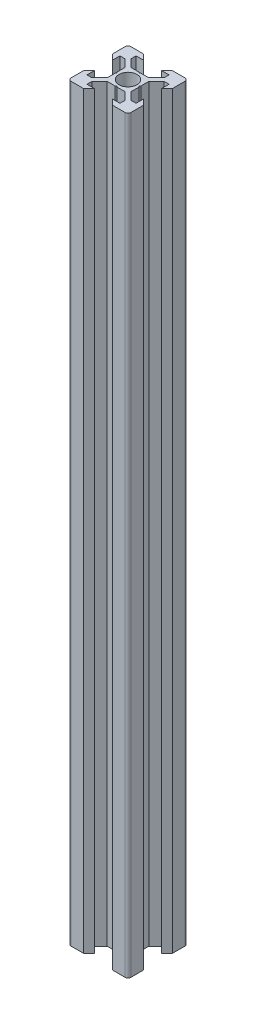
ISO-10303-21;
HEADER;
FILE_DESCRIPTION(('STEP AP214'),'2;1');
FILE_NAME('part.step','',(''),(''),'','','');
FILE_SCHEMA(('AUTOMOTIVE_DESIGN { 1 0 10303 214 1 1 1 1 }'));
ENDSEC;
DATA;
#1=APPLICATION_CONTEXT('core data for automotive mechanical design processes');
#2=APPLICATION_PROTOCOL_DEFINITION('international standard','automotive_design',2000,#1);
#3=PRODUCT_CONTEXT('',#1,'mechanical');
#4=PRODUCT('Part','Part','',(#3));
#5=PRODUCT_RELATED_PRODUCT_CATEGORY('part','',(#4));
#6=PRODUCT_DEFINITION_FORMATION('','',#4);
#7=PRODUCT_DEFINITION_CONTEXT('part definition',#1,'design');
#8=PRODUCT_DEFINITION('design','',#6,#7);
#9=PRODUCT_DEFINITION_SHAPE('','',#8);
#10=(LENGTH_UNIT() NAMED_UNIT(*) SI_UNIT(.MILLI.,.METRE.));
#11=(NAMED_UNIT(*) PLANE_ANGLE_UNIT() SI_UNIT($,.RADIAN.));
#12=(NAMED_UNIT(*) SI_UNIT($,.STERADIAN.) SOLID_ANGLE_UNIT());
#13=UNCERTAINTY_MEASURE_WITH_UNIT(LENGTH_MEASURE(1.E-05),#10,'distance_accuracy_value','');
#14=(GEOMETRIC_REPRESENTATION_CONTEXT(3) GLOBAL_UNCERTAINTY_ASSIGNED_CONTEXT((#13)) GLOBAL_UNIT_ASSIGNED_CONTEXT((#10,
#11,#12)) REPRESENTATION_CONTEXT('',''));
#15=CARTESIAN_POINT('',(0.,0.,0.));
#16=DIRECTION('',(0.,0.,1.));
#17=DIRECTION('',(1.,0.,0.));
#18=AXIS2_PLACEMENT_3D('',#15,#16,#17);
#19=CARTESIAN_POINT('',(8.99964000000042,250.,8.99963999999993));
#20=DIRECTION('',(0.,1.,0.));
#21=DIRECTION('',(0.,0.,1.));
#22=AXIS2_PLACEMENT_3D('',#19,#20,#21);
#23=PLANE('',#22);
#24=CARTESIAN_POINT('',(8.99964000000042,250.,8.99963999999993));
#25=DIRECTION('',(0.,1.,0.));
#26=DIRECTION('',(0.,0.,1.));
#27=AXIS2_PLACEMENT_3D('',#24,#25,#26);
#28=CIRCLE('',#27,0.99996);
#29=CARTESIAN_POINT('',(8.99964000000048,250.,9.99959999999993));
#30=VERTEX_POINT('',#29);
#31=CARTESIAN_POINT('',(9.99960000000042,250.,8.99963999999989));
#32=VERTEX_POINT('',#31);
#33=EDGE_CURVE('E567',#30,#32,#28,.T.);
#34=ORIENTED_EDGE('',*,*,#33,.T.);
#35=DIRECTION('',(0.,0.,-1.));
#36=VECTOR('',#35,1.);
#37=CARTESIAN_POINT('',(9.99960000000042,250.,8.99963999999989));
#38=LINE('',#37,#36);
#39=CARTESIAN_POINT('',(9.99960000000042,250.,4.79980799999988));
#40=VERTEX_POINT('',#39);
#41=EDGE_CURVE('E255',#32,#40,#38,.T.);
#42=ORIENTED_EDGE('',*,*,#41,.T.);
#43=DIRECTION('',(-0.707106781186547,0.,-0.707106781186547));
#44=VECTOR('',#43,1.);
#45=CARTESIAN_POINT('',(9.99960000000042,250.,4.79980799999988));
#46=LINE('',#45,#44);
#47=CARTESIAN_POINT('',(8.19967200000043,250.,2.99987999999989));
#48=VERTEX_POINT('',#47);
#49=EDGE_CURVE('E738',#40,#48,#46,.T.);
#50=ORIENTED_EDGE('',*,*,#49,.T.);
#51=DIRECTION('',(0.,0.,1.));
#52=VECTOR('',#51,1.);
#53=CARTESIAN_POINT('',(8.19967200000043,250.,2.99987999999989));
#54=LINE('',#53,#52);
#55=CARTESIAN_POINT('',(8.19967200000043,250.,5.49977999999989));
#56=VERTEX_POINT('',#55);
#57=EDGE_CURVE('E757',#48,#56,#54,.T.);
#58=ORIENTED_EDGE('',*,*,#57,.T.);
#59=DIRECTION('',(-1.,0.,0.));
#60=VECTOR('',#59,1.);
#61=CARTESIAN_POINT('',(8.19967200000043,250.,5.49977999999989));
#62=LINE('',#61,#60);
#63=CARTESIAN_POINT('',(6.56039774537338,250.,5.49977999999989));
#64=VERTEX_POINT('',#63);
#65=EDGE_CURVE('E754',#56,#64,#62,.T.);
#66=ORIENTED_EDGE('',*,*,#65,.T.);
#67=DIRECTION('',(-0.707106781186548,0.,-0.707106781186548));
#68=VECTOR('',#67,1.);
#69=CARTESIAN_POINT('',(6.56039774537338,250.,5.49977999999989));
#70=LINE('',#69,#68);
#71=CARTESIAN_POINT('',(3.99984000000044,250.,2.93922225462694));
#72=VERTEX_POINT('',#71);
#73=EDGE_CURVE('E756',#64,#72,#70,.T.);
#74=ORIENTED_EDGE('',*,*,#73,.T.);
#75=DIRECTION('',(0.,0.,-1.));
#76=VECTOR('',#75,1.);
#77=CARTESIAN_POINT('',(3.99984000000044,250.,2.93922225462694));
#78=LINE('',#77,#76);
#79=CARTESIAN_POINT('',(3.99984000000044,250.,0.299987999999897));
#80=VERTEX_POINT('',#79);
#81=EDGE_CURVE('E759',#72,#80,#78,.T.);
#82=ORIENTED_EDGE('',*,*,#81,.T.);
#83=DIRECTION('',(-0.707106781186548,0.,-0.707106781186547));
#84=VECTOR('',#83,1.);
#85=CARTESIAN_POINT('',(3.99984000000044,250.,0.299987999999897));
#86=LINE('',#85,#84);
#87=CARTESIAN_POINT('',(3.69985200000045,250.,0.));
#88=VERTEX_POINT('',#87);
#89=EDGE_CURVE('E765',#80,#88,#86,.T.);
#90=ORIENTED_EDGE('',*,*,#89,.T.);
#91=DIRECTION('',(0.707106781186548,0.,-0.707106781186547));
#92=VECTOR('',#91,1.);
#93=CARTESIAN_POINT('',(3.69985200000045,250.,0.));
#94=LINE('',#93,#92);
#95=CARTESIAN_POINT('',(3.99984000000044,250.,-0.299988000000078));
#96=VERTEX_POINT('',#95);
#97=EDGE_CURVE('E767',#88,#96,#94,.T.);
#98=ORIENTED_EDGE('',*,*,#97,.T.);
#99=DIRECTION('',(0.,0.,-1.));
#100=VECTOR('',#99,1.);
#101=CARTESIAN_POINT('',(3.99984000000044,250.,-0.299988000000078));
#102=LINE('',#101,#100);
#103=CARTESIAN_POINT('',(3.99984000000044,250.,-2.93922225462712));
#104=VERTEX_POINT('',#103);
#105=EDGE_CURVE('E769',#96,#104,#102,.T.);
#106=ORIENTED_EDGE('',*,*,#105,.T.);
#107=DIRECTION('',(0.707106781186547,0.,-0.707106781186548));
#108=VECTOR('',#107,1.);
#109=CARTESIAN_POINT('',(3.99984000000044,250.,-2.93922225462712));
#110=LINE('',#109,#108);
#111=CARTESIAN_POINT('',(6.56039774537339,250.,-5.49978000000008));
#112=VERTEX_POINT('',#111);
#113=EDGE_CURVE('E771',#104,#112,#110,.T.);
#114=ORIENTED_EDGE('',*,*,#113,.T.);
#115=DIRECTION('',(1.,0.,0.));
#116=VECTOR('',#115,1.);
#117=CARTESIAN_POINT('',(6.56039774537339,250.,-5.49978000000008));
#118=LINE('',#117,#116);
#119=CARTESIAN_POINT('',(8.1996720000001,250.,-5.49978000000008));
#120=VERTEX_POINT('',#119);
#121=EDGE_CURVE('E773',#112,#120,#118,.T.);
#122=ORIENTED_EDGE('',*,*,#121,.T.);
#123=DIRECTION('',(0.,0.,1.));
#124=VECTOR('',#123,1.);
#125=CARTESIAN_POINT('',(8.1996720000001,250.,-5.49978000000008));
#126=LINE('',#125,#124);
#127=CARTESIAN_POINT('',(8.1996720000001,250.,-2.99987999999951));
#128=VERTEX_POINT('',#127);
#129=EDGE_CURVE('E775',#120,#128,#126,.T.);
#130=ORIENTED_EDGE('',*,*,#129,.T.);
#131=DIRECTION('',(0.707106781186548,0.,-0.707106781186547));
#132=VECTOR('',#131,1.);
#133=CARTESIAN_POINT('',(8.1996720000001,250.,-2.99987999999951));
#134=LINE('',#133,#132);
#135=CARTESIAN_POINT('',(9.99960000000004,250.,-4.79980799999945));
#136=VERTEX_POINT('',#135);
#137=EDGE_CURVE('E777',#128,#136,#134,.T.);
#138=ORIENTED_EDGE('',*,*,#137,.T.);
#139=DIRECTION('',(0.,0.,-1.));
#140=VECTOR('',#139,1.);
#141=CARTESIAN_POINT('',(9.99960000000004,250.,-4.79980799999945));
#142=LINE('',#141,#140);
#143=CARTESIAN_POINT('',(9.99960000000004,250.,-8.99963999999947));
#144=VERTEX_POINT('',#143);
#145=EDGE_CURVE('E779',#136,#144,#142,.T.);
#146=ORIENTED_EDGE('',*,*,#145,.T.);
#147=CARTESIAN_POINT('',(8.99964000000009,250.,-8.9996399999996));
#148=DIRECTION('',(0.,1.,0.));
#149=DIRECTION('',(0.,0.,1.));
#150=AXIS2_PLACEMENT_3D('',#147,#148,#149);
#151=CIRCLE('',#150,0.999959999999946);
#152=CARTESIAN_POINT('',(8.99964000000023,250.,-9.99959999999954));
#153=VERTEX_POINT('',#152);
#154=EDGE_CURVE('E781',#144,#153,#151,.T.);
#155=ORIENTED_EDGE('',*,*,#154,.T.);
#156=DIRECTION('',(-1.,0.,0.));
#157=VECTOR('',#156,1.);
#158=CARTESIAN_POINT('',(8.99964000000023,250.,-9.99959999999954));
#159=LINE('',#158,#157);
#160=CARTESIAN_POINT('',(4.79980800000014,250.,-9.99959999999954));
#161=VERTEX_POINT('',#160);
#162=EDGE_CURVE('E783',#153,#161,#159,.T.);
#163=ORIENTED_EDGE('',*,*,#162,.T.);
#164=DIRECTION('',(-0.707106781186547,0.,0.707106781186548));
#165=VECTOR('',#164,1.);
#166=CARTESIAN_POINT('',(4.79980800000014,250.,-9.99959999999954));
#167=LINE('',#166,#165);
#168=CARTESIAN_POINT('',(2.99988000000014,250.,-8.19967199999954));
#169=VERTEX_POINT('',#168);
#170=EDGE_CURVE('E785',#161,#169,#167,.T.);
#171=ORIENTED_EDGE('',*,*,#170,.T.);
#172=DIRECTION('',(1.,0.,0.));
#173=VECTOR('',#172,1.);
#174=CARTESIAN_POINT('',(2.99988000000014,250.,-8.19967199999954));
#175=LINE('',#174,#173);
#176=CARTESIAN_POINT('',(5.49978000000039,250.,-8.19967199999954));
#177=VERTEX_POINT('',#176);
#178=EDGE_CURVE('E787',#169,#177,#175,.T.);
#179=ORIENTED_EDGE('',*,*,#178,.T.);
#180=DIRECTION('',(0.,0.,1.));
#181=VECTOR('',#180,1.);
#182=CARTESIAN_POINT('',(5.49978000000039,250.,-8.19967199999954));
#183=LINE('',#182,#181);
#184=CARTESIAN_POINT('',(5.49978000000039,250.,-6.56039774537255));
#185=VERTEX_POINT('',#184);
#186=EDGE_CURVE('E789',#177,#185,#183,.T.);
#187=ORIENTED_EDGE('',*,*,#186,.T.);
#188=DIRECTION('',(-0.707106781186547,0.,0.707106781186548));
#189=VECTOR('',#188,1.);
#190=CARTESIAN_POINT('',(5.49978000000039,250.,-6.56039774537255));
#191=LINE('',#190,#189);
#192=CARTESIAN_POINT('',(2.93922225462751,250.,-3.99983999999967));
#193=VERTEX_POINT('',#192);
#194=EDGE_CURVE('E791',#185,#193,#191,.T.);
#195=ORIENTED_EDGE('',*,*,#194,.T.);
#196=DIRECTION('',(-1.,0.,0.));
#197=VECTOR('',#196,1.);
#198=CARTESIAN_POINT('',(2.93922225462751,250.,-3.99983999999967));
#199=LINE('',#198,#197);
#200=CARTESIAN_POINT('',(0.299988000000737,250.,-3.99983999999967));
#201=VERTEX_POINT('',#200);
#202=EDGE_CURVE('E793',#193,#201,#199,.T.);
#203=ORIENTED_EDGE('',*,*,#202,.T.);
#204=DIRECTION('',(-0.707106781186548,0.,0.707106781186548));
#205=VECTOR('',#204,1.);
#206=CARTESIAN_POINT('',(0.299988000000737,250.,-3.99983999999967));
#207=LINE('',#206,#205);
#208=CARTESIAN_POINT('',(7.49352141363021E-13,250.,-3.69985199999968));
#209=VERTEX_POINT('',#208);
#210=EDGE_CURVE('E795',#201,#209,#207,.T.);
#211=ORIENTED_EDGE('',*,*,#210,.T.);
#212=DIRECTION('',(-0.707106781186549,0.,-0.707106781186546));
#213=VECTOR('',#212,1.);
#214=CARTESIAN_POINT('',(7.49352141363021E-13,250.,-3.69985199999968));
#215=LINE('',#214,#213);
#216=CARTESIAN_POINT('',(-0.299987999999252,250.,-3.99983999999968));
#217=VERTEX_POINT('',#216);
#218=EDGE_CURVE('E797',#209,#217,#215,.T.);
#219=ORIENTED_EDGE('',*,*,#218,.T.);
#220=DIRECTION('',(-1.,0.,0.));
#221=VECTOR('',#220,1.);
#222=CARTESIAN_POINT('',(-0.299987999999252,250.,-3.99983999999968));
#223=LINE('',#222,#221);
#224=CARTESIAN_POINT('',(-2.9392222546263,250.,-3.99983999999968));
#225=VERTEX_POINT('',#224);
#226=EDGE_CURVE('E799',#217,#225,#223,.T.);
#227=ORIENTED_EDGE('',*,*,#226,.T.);
#228=DIRECTION('',(-0.707106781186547,0.,-0.707106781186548));
#229=VECTOR('',#228,1.);
#230=CARTESIAN_POINT('',(-2.9392222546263,250.,-3.99983999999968));
#231=LINE('',#230,#229);
#232=CARTESIAN_POINT('',(-5.49977999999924,250.,-6.56039774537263));
#233=VERTEX_POINT('',#232);
#234=EDGE_CURVE('E801',#225,#233,#231,.T.);
#235=ORIENTED_EDGE('',*,*,#234,.T.);
#236=DIRECTION('',(0.,0.,-1.));
#237=VECTOR('',#236,1.);
#238=CARTESIAN_POINT('',(-5.49977999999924,250.,-6.56039774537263));
#239=LINE('',#238,#237);
#240=CARTESIAN_POINT('',(-5.49977999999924,250.,-8.19967200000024));
#241=VERTEX_POINT('',#240);
#242=EDGE_CURVE('E803',#233,#241,#239,.T.);
#243=ORIENTED_EDGE('',*,*,#242,.T.);
#244=DIRECTION('',(1.,0.,0.));
#245=VECTOR('',#244,1.);
#246=CARTESIAN_POINT('',(-5.49977999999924,250.,-8.19967200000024));
#247=LINE('',#246,#245);
#248=CARTESIAN_POINT('',(-2.99988000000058,250.,-8.19967200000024));
#249=VERTEX_POINT('',#248);
#250=EDGE_CURVE('E805',#241,#249,#247,.T.);
#251=ORIENTED_EDGE('',*,*,#250,.T.);
#252=DIRECTION('',(-0.707106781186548,0.,-0.707106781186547));
#253=VECTOR('',#252,1.);
#254=CARTESIAN_POINT('',(-2.99988000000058,250.,-8.19967200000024));
#255=LINE('',#254,#253);
#256=CARTESIAN_POINT('',(-4.79980800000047,250.,-9.99960000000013));
#257=VERTEX_POINT('',#256);
#258=EDGE_CURVE('E807',#249,#257,#255,.T.);
#259=ORIENTED_EDGE('',*,*,#258,.T.);
#260=DIRECTION('',(-1.,0.,0.));
#261=VECTOR('',#260,1.);
#262=CARTESIAN_POINT('',(-4.79980800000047,250.,-9.99960000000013));
#263=LINE('',#262,#261);
#264=CARTESIAN_POINT('',(-8.99963999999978,250.,-9.99960000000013));
#265=VERTEX_POINT('',#264);
#266=EDGE_CURVE('E809',#257,#265,#263,.T.);
#267=ORIENTED_EDGE('',*,*,#266,.T.);
#268=CARTESIAN_POINT('',(-8.99963999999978,250.,-8.99964000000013));
#269=DIRECTION('',(0.,1.,0.));
#270=DIRECTION('',(0.,0.,1.));
#271=AXIS2_PLACEMENT_3D('',#268,#269,#270);
#272=CIRCLE('',#271,0.999959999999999);
#273=CARTESIAN_POINT('',(-9.99959999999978,250.,-8.99964000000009));
#274=VERTEX_POINT('',#273);
#275=EDGE_CURVE('E811',#265,#274,#272,.T.);
#276=ORIENTED_EDGE('',*,*,#275,.T.);
#277=DIRECTION('',(0.,0.,1.));
#278=VECTOR('',#277,1.);
#279=CARTESIAN_POINT('',(-9.99959999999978,250.,-8.99964000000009));
#280=LINE('',#279,#278);
#281=CARTESIAN_POINT('',(-9.99959999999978,250.,-4.79980800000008));
#282=VERTEX_POINT('',#281);
#283=EDGE_CURVE('E813',#274,#282,#280,.T.);
#284=ORIENTED_EDGE('',*,*,#283,.T.);
#285=DIRECTION('',(0.707106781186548,0.,0.707106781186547));
#286=VECTOR('',#285,1.);
#287=CARTESIAN_POINT('',(-9.99959999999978,250.,-4.79980800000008));
#288=LINE('',#287,#286);
#289=CARTESIAN_POINT('',(-8.19967199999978,250.,-2.99988000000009));
#290=VERTEX_POINT('',#289);
#291=EDGE_CURVE('E815',#282,#290,#288,.T.);
#292=ORIENTED_EDGE('',*,*,#291,.T.);
#293=DIRECTION('',(0.,0.,-1.));
#294=VECTOR('',#293,1.);
#295=CARTESIAN_POINT('',(-8.19967199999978,250.,-2.99988000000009));
#296=LINE('',#295,#294);
#297=CARTESIAN_POINT('',(-8.19967199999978,250.,-5.49978000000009));
#298=VERTEX_POINT('',#297);
#299=EDGE_CURVE('E817',#290,#298,#296,.T.);
#300=ORIENTED_EDGE('',*,*,#299,.T.);
#301=DIRECTION('',(1.,0.,0.));
#302=VECTOR('',#301,1.);
#303=CARTESIAN_POINT('',(-8.19967199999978,250.,-5.49978000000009));
#304=LINE('',#303,#302);
#305=CARTESIAN_POINT('',(-6.56039774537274,250.,-5.49978000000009));
#306=VERTEX_POINT('',#305);
#307=EDGE_CURVE('E819',#298,#306,#304,.T.);
#308=ORIENTED_EDGE('',*,*,#307,.T.);
#309=DIRECTION('',(0.707106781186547,0.,0.707106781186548));
#310=VECTOR('',#309,1.);
#311=CARTESIAN_POINT('',(-6.56039774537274,250.,-5.49978000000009));
#312=LINE('',#311,#310);
#313=CARTESIAN_POINT('',(-3.9998399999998,250.,-2.93922225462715));
#314=VERTEX_POINT('',#313);
#315=EDGE_CURVE('E821',#306,#314,#312,.T.);
#316=ORIENTED_EDGE('',*,*,#315,.T.);
#317=DIRECTION('',(0.,0.,1.));
#318=VECTOR('',#317,1.);
#319=CARTESIAN_POINT('',(-3.9998399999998,250.,-2.93922225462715));
#320=LINE('',#319,#318);
#321=CARTESIAN_POINT('',(-3.9998399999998,250.,-0.299988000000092));
#322=VERTEX_POINT('',#321);
#323=EDGE_CURVE('E823',#314,#322,#320,.T.);
#324=ORIENTED_EDGE('',*,*,#323,.T.);
#325=DIRECTION('',(0.707106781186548,0.,0.707106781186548));
#326=VECTOR('',#325,1.);
#327=CARTESIAN_POINT('',(-3.9998399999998,250.,-0.299988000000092));
#328=LINE('',#327,#326);
#329=CARTESIAN_POINT('',(-3.69985199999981,250.,-1.04081468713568E-13));
#330=VERTEX_POINT('',#329);
#331=EDGE_CURVE('E825',#322,#330,#328,.T.);
#332=ORIENTED_EDGE('',*,*,#331,.T.);
#333=DIRECTION('',(-0.707106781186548,0.,0.707106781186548));
#334=VECTOR('',#333,1.);
#335=CARTESIAN_POINT('',(-3.69985199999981,250.,-1.04081468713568E-13));
#336=LINE('',#335,#334);
#337=CARTESIAN_POINT('',(-3.9998399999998,250.,0.299987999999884));
#338=VERTEX_POINT('',#337);
#339=EDGE_CURVE('E827',#330,#338,#336,.T.);
#340=ORIENTED_EDGE('',*,*,#339,.T.);
#341=DIRECTION('',(0.,0.,1.));
#342=VECTOR('',#341,1.);
#343=CARTESIAN_POINT('',(-3.9998399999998,250.,0.299987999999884));
#344=LINE('',#343,#342);
#345=CARTESIAN_POINT('',(-3.99983999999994,250.,2.93922225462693));
#346=VERTEX_POINT('',#345);
#347=EDGE_CURVE('E829',#338,#346,#344,.T.);
#348=ORIENTED_EDGE('',*,*,#347,.T.);
#349=DIRECTION('',(-0.707106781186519,0.,0.707106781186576));
#350=VECTOR('',#349,1.);
#351=CARTESIAN_POINT('',(-3.99983999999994,250.,2.93922225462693));
#352=LINE('',#351,#350);
#353=CARTESIAN_POINT('',(-6.56039774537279,250.,5.49977999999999));
#354=VERTEX_POINT('',#353);
#355=EDGE_CURVE('E831',#346,#354,#352,.T.);
#356=ORIENTED_EDGE('',*,*,#355,.T.);
#357=DIRECTION('',(-1.,0.,0.));
#358=VECTOR('',#357,1.);
#359=CARTESIAN_POINT('',(-6.56039774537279,250.,5.49977999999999));
#360=LINE('',#359,#358);
#361=CARTESIAN_POINT('',(-8.19967199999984,250.,5.49978000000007));
#362=VERTEX_POINT('',#361);
#363=EDGE_CURVE('E833',#354,#362,#360,.T.);
#364=ORIENTED_EDGE('',*,*,#363,.T.);
#365=DIRECTION('',(0.,0.,-1.));
#366=VECTOR('',#365,1.);
#367=CARTESIAN_POINT('',(-8.19967199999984,250.,5.49978000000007));
#368=LINE('',#367,#366);
#369=CARTESIAN_POINT('',(-8.19967199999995,250.,2.99988000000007));
#370=VERTEX_POINT('',#369);
#371=EDGE_CURVE('E835',#362,#370,#368,.T.);
#372=ORIENTED_EDGE('',*,*,#371,.T.);
#373=DIRECTION('',(-0.707106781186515,0.,0.70710678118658));
#374=VECTOR('',#373,1.);
#375=CARTESIAN_POINT('',(-8.19967199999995,250.,2.99988000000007));
#376=LINE('',#375,#374);
#377=CARTESIAN_POINT('',(-9.99959999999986,250.,4.79980800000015));
#378=VERTEX_POINT('',#377);
#379=EDGE_CURVE('E837',#370,#378,#376,.T.);
#380=ORIENTED_EDGE('',*,*,#379,.T.);
#381=DIRECTION('',(0.,0.,1.));
#382=VECTOR('',#381,1.);
#383=CARTESIAN_POINT('',(-9.99959999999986,250.,4.79980800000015));
#384=LINE('',#383,#382);
#385=CARTESIAN_POINT('',(-9.99959999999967,250.,8.99964000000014));
#386=VERTEX_POINT('',#385);
#387=EDGE_CURVE('E839',#378,#386,#384,.T.);
#388=ORIENTED_EDGE('',*,*,#387,.T.);
#389=CARTESIAN_POINT('',(-8.99963999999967,250.,8.9996400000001));
#390=DIRECTION('',(0.,1.,0.));
#391=DIRECTION('',(0.,0.,1.));
#392=AXIS2_PLACEMENT_3D('',#389,#390,#391);
#393=CIRCLE('',#392,0.99996);
#394=CARTESIAN_POINT('',(-8.99963999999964,250.,9.9996000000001));
#395=VERTEX_POINT('',#394);
#396=EDGE_CURVE('E841',#386,#395,#393,.T.);
#397=ORIENTED_EDGE('',*,*,#396,.T.);
#398=DIRECTION('',(1.,0.,0.));
#399=VECTOR('',#398,1.);
#400=CARTESIAN_POINT('',(-8.99963999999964,250.,9.9996000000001));
#401=LINE('',#400,#399);
#402=CARTESIAN_POINT('',(-4.79980799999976,250.,9.9996000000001));
#403=VERTEX_POINT('',#402);
#404=EDGE_CURVE('E843',#395,#403,#401,.T.);
#405=ORIENTED_EDGE('',*,*,#404,.T.);
#406=DIRECTION('',(0.707106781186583,0.,-0.707106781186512));
#407=VECTOR('',#406,1.);
#408=CARTESIAN_POINT('',(-4.79980799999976,250.,9.9996000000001));
#409=LINE('',#408,#407);
#410=CARTESIAN_POINT('',(-2.99987999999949,250.,8.19967200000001));
#411=VERTEX_POINT('',#410);
#412=EDGE_CURVE('E845',#403,#411,#409,.T.);
#413=ORIENTED_EDGE('',*,*,#412,.T.);
#414=DIRECTION('',(-1.,0.,0.));
#415=VECTOR('',#414,1.);
#416=CARTESIAN_POINT('',(-2.99987999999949,250.,8.19967200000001));
#417=LINE('',#416,#415);
#418=CARTESIAN_POINT('',(-5.49977999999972,250.,8.19967199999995));
#419=VERTEX_POINT('',#418);
#420=EDGE_CURVE('E847',#411,#419,#417,.T.);
#421=ORIENTED_EDGE('',*,*,#420,.T.);
#422=DIRECTION('',(0.,0.,-1.));
#423=VECTOR('',#422,1.);
#424=CARTESIAN_POINT('',(-5.49977999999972,250.,8.19967199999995));
#425=LINE('',#424,#423);
#426=CARTESIAN_POINT('',(-5.49977999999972,250.,6.56039774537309));
#427=VERTEX_POINT('',#426);
#428=EDGE_CURVE('E849',#419,#427,#425,.T.);
#429=ORIENTED_EDGE('',*,*,#428,.T.);
#430=DIRECTION('',(0.707106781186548,0.,-0.707106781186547));
#431=VECTOR('',#430,1.);
#432=CARTESIAN_POINT('',(-5.49977999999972,250.,6.56039774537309));
#433=LINE('',#432,#431);
#434=CARTESIAN_POINT('',(-2.93922225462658,250.,3.99983999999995));
#435=VERTEX_POINT('',#434);
#436=EDGE_CURVE('E851',#427,#435,#433,.T.);
#437=ORIENTED_EDGE('',*,*,#436,.T.);
#438=DIRECTION('',(1.,0.,0.));
#439=VECTOR('',#438,1.);
#440=CARTESIAN_POINT('',(-2.93922225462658,250.,3.99983999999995));
#441=LINE('',#440,#439);
#442=CARTESIAN_POINT('',(-0.299987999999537,250.,3.99983999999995));
#443=VERTEX_POINT('',#442);
#444=EDGE_CURVE('E853',#435,#443,#441,.T.);
#445=ORIENTED_EDGE('',*,*,#444,.T.);
#446=DIRECTION('',(0.707106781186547,0.,-0.707106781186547));
#447=VECTOR('',#446,1.);
#448=CARTESIAN_POINT('',(-0.299987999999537,250.,3.99983999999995));
#449=LINE('',#448,#447);
#450=CARTESIAN_POINT('',(4.57894783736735E-13,250.,3.69985199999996));
#451=VERTEX_POINT('',#450);
#452=EDGE_CURVE('E855',#443,#451,#449,.T.);
#453=ORIENTED_EDGE('',*,*,#452,.T.);
#454=DIRECTION('',(0.707106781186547,0.,0.707106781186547));
#455=VECTOR('',#454,1.);
#456=CARTESIAN_POINT('',(4.57894783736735E-13,250.,3.69985199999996));
#457=LINE('',#456,#455);
#458=CARTESIAN_POINT('',(0.299988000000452,250.,3.99983999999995));
#459=VERTEX_POINT('',#458);
#460=EDGE_CURVE('E857',#451,#459,#457,.T.);
#461=ORIENTED_EDGE('',*,*,#460,.T.);
#462=DIRECTION('',(1.,0.,0.));
#463=VECTOR('',#462,1.);
#464=CARTESIAN_POINT('',(0.299988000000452,250.,3.99983999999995));
#465=LINE('',#464,#463);
#466=CARTESIAN_POINT('',(2.93922225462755,250.,3.99983999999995));
#467=VERTEX_POINT('',#466);
#468=EDGE_CURVE('E859',#459,#467,#465,.T.);
#469=ORIENTED_EDGE('',*,*,#468,.T.);
#470=DIRECTION('',(0.707106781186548,0.,0.707106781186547));
#471=VECTOR('',#470,1.);
#472=CARTESIAN_POINT('',(2.93922225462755,250.,3.99983999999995));
#473=LINE('',#472,#471);
#474=CARTESIAN_POINT('',(5.49978000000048,250.,6.56039774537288));
#475=VERTEX_POINT('',#474);
#476=EDGE_CURVE('E861',#467,#475,#473,.T.);
#477=ORIENTED_EDGE('',*,*,#476,.T.);
#478=DIRECTION('',(0.,0.,1.));
#479=VECTOR('',#478,1.);
#480=CARTESIAN_POINT('',(5.49978000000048,250.,6.56039774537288));
#481=LINE('',#480,#479);
#482=CARTESIAN_POINT('',(5.49978000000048,250.,8.19967199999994));
#483=VERTEX_POINT('',#482);
#484=EDGE_CURVE('E430',#475,#483,#481,.T.);
#485=ORIENTED_EDGE('',*,*,#484,.T.);
#486=DIRECTION('',(-1.,0.,0.));
#487=VECTOR('',#486,1.);
#488=CARTESIAN_POINT('',(5.49978000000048,250.,8.19967199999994));
#489=LINE('',#488,#487);
#490=CARTESIAN_POINT('',(2.99988000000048,250.,8.19967199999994));
#491=VERTEX_POINT('',#490);
#492=EDGE_CURVE('E424',#483,#491,#489,.T.);
#493=ORIENTED_EDGE('',*,*,#492,.T.);
#494=DIRECTION('',(0.707106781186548,0.,0.707106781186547));
#495=VECTOR('',#494,1.);
#496=CARTESIAN_POINT('',(2.99988000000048,250.,8.19967199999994));
#497=LINE('',#496,#495);
#498=CARTESIAN_POINT('',(4.79980800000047,250.,9.99959999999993));
#499=VERTEX_POINT('',#498);
#500=EDGE_CURVE('E428',#491,#499,#497,.T.);
#501=ORIENTED_EDGE('',*,*,#500,.T.);
#502=DIRECTION('',(1.,0.,0.));
#503=VECTOR('',#502,1.);
#504=CARTESIAN_POINT('',(4.79980800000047,250.,9.99959999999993));
#505=LINE('',#504,#503);
#506=EDGE_CURVE('E56',#499,#30,#505,.T.);
#507=ORIENTED_EDGE('',*,*,#506,.T.);
#508=EDGE_LOOP('',(#34,#42,#50,#58,#66,#74,#82,#90,#98,#106,#114,#122,#130,#138,#146,#155,#163,
#171,#179,#187,#195,#203,#211,#219,#227,#235,#243,#251,#259,#267,#276,#284,#292,#300,#308,#316,
#324,#332,#340,#348,#356,#364,#372,#380,#388,#397,#405,#413,#421,#429,#437,#445,#453,#461,#469,
#477,#485,#493,#501,#507));
#509=FACE_BOUND('',#508,.T.);
#510=CARTESIAN_POINT('',(0.,250.,0.));
#511=DIRECTION('',(0.,1.,0.));
#512=DIRECTION('',(0.,0.,1.));
#513=AXIS2_PLACEMENT_3D('',#510,#511,#512);
#514=CIRCLE('',#513,3.);
#515=CARTESIAN_POINT('',(0.,250.,3.));
#516=VERTEX_POINT('',#515);
#517=EDGE_CURVE('E452',#516,#516,#514,.T.);
#518=ORIENTED_EDGE('',*,*,#517,.F.);
#519=EDGE_LOOP('',(#518));
#520=FACE_BOUND('',#519,.T.);
#521=ADVANCED_FACE('F39',(#509,#520),#23,.T.);
#522=CARTESIAN_POINT('',(8.99964000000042,0.,8.99963999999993));
#523=DIRECTION('',(0.,1.,0.));
#524=DIRECTION('',(0.,0.,1.));
#525=AXIS2_PLACEMENT_3D('',#522,#523,#524);
#526=PLANE('',#525);
#527=CARTESIAN_POINT('',(8.99964000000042,0.,8.99963999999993));
#528=DIRECTION('',(0.,1.,0.));
#529=DIRECTION('',(0.,0.,1.));
#530=AXIS2_PLACEMENT_3D('',#527,#528,#529);
#531=CIRCLE('',#530,0.99996);
#532=CARTESIAN_POINT('',(8.99964000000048,0.,9.99959999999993));
#533=VERTEX_POINT('',#532);
#534=CARTESIAN_POINT('',(9.99960000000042,0.,8.99963999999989));
#535=VERTEX_POINT('',#534);
#536=EDGE_CURVE('E448',#533,#535,#531,.T.);
#537=ORIENTED_EDGE('',*,*,#536,.F.);
#538=DIRECTION('',(1.,0.,0.));
#539=VECTOR('',#538,1.);
#540=CARTESIAN_POINT('',(4.79980800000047,0.,9.99959999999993));
#541=LINE('',#540,#539);
#542=CARTESIAN_POINT('',(4.79980800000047,0.,9.99959999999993));
#543=VERTEX_POINT('',#542);
#544=EDGE_CURVE('E247',#543,#533,#541,.T.);
#545=ORIENTED_EDGE('',*,*,#544,.F.);
#546=DIRECTION('',(0.707106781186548,0.,0.707106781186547));
#547=VECTOR('',#546,1.);
#548=CARTESIAN_POINT('',(2.99988000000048,0.,8.19967199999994));
#549=LINE('',#548,#547);
#550=CARTESIAN_POINT('',(2.99988000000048,0.,8.19967199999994));
#551=VERTEX_POINT('',#550);
#552=EDGE_CURVE('E241',#551,#543,#549,.T.);
#553=ORIENTED_EDGE('',*,*,#552,.F.);
#554=DIRECTION('',(-1.,0.,0.));
#555=VECTOR('',#554,1.);
#556=CARTESIAN_POINT('',(5.49978000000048,0.,8.19967199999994));
#557=LINE('',#556,#555);
#558=CARTESIAN_POINT('',(5.49978000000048,0.,8.19967199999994));
#559=VERTEX_POINT('',#558);
#560=EDGE_CURVE('E438',#559,#551,#557,.T.);
#561=ORIENTED_EDGE('',*,*,#560,.F.);
#562=DIRECTION('',(0.,0.,1.));
#563=VECTOR('',#562,1.);
#564=CARTESIAN_POINT('',(5.49978000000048,0.,6.56039774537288));
#565=LINE('',#564,#563);
#566=CARTESIAN_POINT('',(5.49978000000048,0.,6.56039774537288));
#567=VERTEX_POINT('',#566);
#568=EDGE_CURVE('E562',#567,#559,#565,.T.);
#569=ORIENTED_EDGE('',*,*,#568,.F.);
#570=DIRECTION('',(0.707106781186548,0.,0.707106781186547));
#571=VECTOR('',#570,1.);
#572=CARTESIAN_POINT('',(2.93922225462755,0.,3.99983999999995));
#573=LINE('',#572,#571);
#574=CARTESIAN_POINT('',(2.93922225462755,0.,3.99983999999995));
#575=VERTEX_POINT('',#574);
#576=EDGE_CURVE('E560',#575,#567,#573,.T.);
#577=ORIENTED_EDGE('',*,*,#576,.F.);
#578=DIRECTION('',(1.,0.,0.));
#579=VECTOR('',#578,1.);
#580=CARTESIAN_POINT('',(0.299988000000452,0.,3.99983999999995));
#581=LINE('',#580,#579);
#582=CARTESIAN_POINT('',(0.299988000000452,0.,3.99983999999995));
#583=VERTEX_POINT('',#582);
#584=EDGE_CURVE('E558',#583,#575,#581,.T.);
#585=ORIENTED_EDGE('',*,*,#584,.F.);
#586=DIRECTION('',(0.707106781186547,0.,0.707106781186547));
#587=VECTOR('',#586,1.);
#588=CARTESIAN_POINT('',(4.57894783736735E-13,0.,3.69985199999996));
#589=LINE('',#588,#587);
#590=CARTESIAN_POINT('',(4.57894783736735E-13,0.,3.69985199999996));
#591=VERTEX_POINT('',#590);
#592=EDGE_CURVE('E556',#591,#583,#589,.T.);
#593=ORIENTED_EDGE('',*,*,#592,.F.);
#594=DIRECTION('',(0.707106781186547,0.,-0.707106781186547));
#595=VECTOR('',#594,1.);
#596=CARTESIAN_POINT('',(-0.299987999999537,0.,3.99983999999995));
#597=LINE('',#596,#595);
#598=CARTESIAN_POINT('',(-0.299987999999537,0.,3.99983999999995));
#599=VERTEX_POINT('',#598);
#600=EDGE_CURVE('E554',#599,#591,#597,.T.);
#601=ORIENTED_EDGE('',*,*,#600,.F.);
#602=DIRECTION('',(1.,0.,0.));
#603=VECTOR('',#602,1.);
#604=CARTESIAN_POINT('',(-2.93922225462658,0.,3.99983999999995));
#605=LINE('',#604,#603);
#606=CARTESIAN_POINT('',(-2.93922225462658,0.,3.99983999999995));
#607=VERTEX_POINT('',#606);
#608=EDGE_CURVE('E552',#607,#599,#605,.T.);
#609=ORIENTED_EDGE('',*,*,#608,.F.);
#610=DIRECTION('',(0.707106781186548,0.,-0.707106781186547));
#611=VECTOR('',#610,1.);
#612=CARTESIAN_POINT('',(-5.49977999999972,0.,6.56039774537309));
#613=LINE('',#612,#611);
#614=CARTESIAN_POINT('',(-5.49977999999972,0.,6.56039774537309));
#615=VERTEX_POINT('',#614);
#616=EDGE_CURVE('E550',#615,#607,#613,.T.);
#617=ORIENTED_EDGE('',*,*,#616,.F.);
#618=DIRECTION('',(0.,0.,-1.));
#619=VECTOR('',#618,1.);
#620=CARTESIAN_POINT('',(-5.49977999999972,0.,8.19967199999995));
#621=LINE('',#620,#619);
#622=CARTESIAN_POINT('',(-5.49977999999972,0.,8.19967199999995));
#623=VERTEX_POINT('',#622);
#624=EDGE_CURVE('E548',#623,#615,#621,.T.);
#625=ORIENTED_EDGE('',*,*,#624,.F.);
#626=DIRECTION('',(-1.,0.,0.));
#627=VECTOR('',#626,1.);
#628=CARTESIAN_POINT('',(-2.99987999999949,0.,8.19967200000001));
#629=LINE('',#628,#627);
#630=CARTESIAN_POINT('',(-2.99987999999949,0.,8.19967200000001));
#631=VERTEX_POINT('',#630);
#632=EDGE_CURVE('E546',#631,#623,#629,.T.);
#633=ORIENTED_EDGE('',*,*,#632,.F.);
#634=DIRECTION('',(0.707106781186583,0.,-0.707106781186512));
#635=VECTOR('',#634,1.);
#636=CARTESIAN_POINT('',(-4.79980799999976,0.,9.9996000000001));
#637=LINE('',#636,#635);
#638=CARTESIAN_POINT('',(-4.79980799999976,0.,9.9996000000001));
#639=VERTEX_POINT('',#638);
#640=EDGE_CURVE('E544',#639,#631,#637,.T.);
#641=ORIENTED_EDGE('',*,*,#640,.F.);
#642=DIRECTION('',(1.,0.,0.));
#643=VECTOR('',#642,1.);
#644=CARTESIAN_POINT('',(-8.99963999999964,0.,9.9996000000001));
#645=LINE('',#644,#643);
#646=CARTESIAN_POINT('',(-8.99963999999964,0.,9.9996000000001));
#647=VERTEX_POINT('',#646);
#648=EDGE_CURVE('E542',#647,#639,#645,.T.);
#649=ORIENTED_EDGE('',*,*,#648,.F.);
#650=CARTESIAN_POINT('',(-8.99963999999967,0.,8.9996400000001));
#651=DIRECTION('',(0.,1.,0.));
#652=DIRECTION('',(0.,0.,1.));
#653=AXIS2_PLACEMENT_3D('',#650,#651,#652);
#654=CIRCLE('',#653,0.99996);
#655=CARTESIAN_POINT('',(-9.99959999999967,0.,8.99964000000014));
#656=VERTEX_POINT('',#655);
#657=EDGE_CURVE('E540',#656,#647,#654,.T.);
#658=ORIENTED_EDGE('',*,*,#657,.F.);
#659=DIRECTION('',(0.,0.,1.));
#660=VECTOR('',#659,1.);
#661=CARTESIAN_POINT('',(-9.99959999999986,0.,4.79980800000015));
#662=LINE('',#661,#660);
#663=CARTESIAN_POINT('',(-9.99959999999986,0.,4.79980800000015));
#664=VERTEX_POINT('',#663);
#665=EDGE_CURVE('E538',#664,#656,#662,.T.);
#666=ORIENTED_EDGE('',*,*,#665,.F.);
#667=DIRECTION('',(-0.707106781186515,0.,0.70710678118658));
#668=VECTOR('',#667,1.);
#669=CARTESIAN_POINT('',(-8.19967199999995,0.,2.99988000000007));
#670=LINE('',#669,#668);
#671=CARTESIAN_POINT('',(-8.19967199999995,0.,2.99988000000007));
#672=VERTEX_POINT('',#671);
#673=EDGE_CURVE('E536',#672,#664,#670,.T.);
#674=ORIENTED_EDGE('',*,*,#673,.F.);
#675=DIRECTION('',(0.,0.,-1.));
#676=VECTOR('',#675,1.);
#677=CARTESIAN_POINT('',(-8.19967199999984,0.,5.49978000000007));
#678=LINE('',#677,#676);
#679=CARTESIAN_POINT('',(-8.19967199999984,0.,5.49978000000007));
#680=VERTEX_POINT('',#679);
#681=EDGE_CURVE('E534',#680,#672,#678,.T.);
#682=ORIENTED_EDGE('',*,*,#681,.F.);
#683=DIRECTION('',(-1.,0.,0.));
#684=VECTOR('',#683,1.);
#685=CARTESIAN_POINT('',(-6.56039774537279,0.,5.49977999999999));
#686=LINE('',#685,#684);
#687=CARTESIAN_POINT('',(-6.56039774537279,0.,5.49977999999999));
#688=VERTEX_POINT('',#687);
#689=EDGE_CURVE('E532',#688,#680,#686,.T.);
#690=ORIENTED_EDGE('',*,*,#689,.F.);
#691=DIRECTION('',(-0.707106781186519,0.,0.707106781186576));
#692=VECTOR('',#691,1.);
#693=CARTESIAN_POINT('',(-3.99983999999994,0.,2.93922225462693));
#694=LINE('',#693,#692);
#695=CARTESIAN_POINT('',(-3.99983999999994,0.,2.93922225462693));
#696=VERTEX_POINT('',#695);
#697=EDGE_CURVE('E530',#696,#688,#694,.T.);
#698=ORIENTED_EDGE('',*,*,#697,.F.);
#699=DIRECTION('',(0.,0.,1.));
#700=VECTOR('',#699,1.);
#701=CARTESIAN_POINT('',(-3.9998399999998,0.,0.299987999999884));
#702=LINE('',#701,#700);
#703=CARTESIAN_POINT('',(-3.9998399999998,0.,0.299987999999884));
#704=VERTEX_POINT('',#703);
#705=EDGE_CURVE('E528',#704,#696,#702,.T.);
#706=ORIENTED_EDGE('',*,*,#705,.F.);
#707=DIRECTION('',(-0.707106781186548,0.,0.707106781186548));
#708=VECTOR('',#707,1.);
#709=CARTESIAN_POINT('',(-3.69985199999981,0.,-1.04081468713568E-13));
#710=LINE('',#709,#708);
#711=CARTESIAN_POINT('',(-3.69985199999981,0.,-1.04081468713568E-13));
#712=VERTEX_POINT('',#711);
#713=EDGE_CURVE('E526',#712,#704,#710,.T.);
#714=ORIENTED_EDGE('',*,*,#713,.F.);
#715=DIRECTION('',(0.707106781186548,0.,0.707106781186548));
#716=VECTOR('',#715,1.);
#717=CARTESIAN_POINT('',(-3.9998399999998,0.,-0.299988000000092));
#718=LINE('',#717,#716);
#719=CARTESIAN_POINT('',(-3.9998399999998,0.,-0.299988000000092));
#720=VERTEX_POINT('',#719);
#721=EDGE_CURVE('E524',#720,#712,#718,.T.);
#722=ORIENTED_EDGE('',*,*,#721,.F.);
#723=DIRECTION('',(0.,0.,1.));
#724=VECTOR('',#723,1.);
#725=CARTESIAN_POINT('',(-3.9998399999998,0.,-2.93922225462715));
#726=LINE('',#725,#724);
#727=CARTESIAN_POINT('',(-3.9998399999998,0.,-2.93922225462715));
#728=VERTEX_POINT('',#727);
#729=EDGE_CURVE('E522',#728,#720,#726,.T.);
#730=ORIENTED_EDGE('',*,*,#729,.F.);
#731=DIRECTION('',(0.707106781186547,0.,0.707106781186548));
#732=VECTOR('',#731,1.);
#733=CARTESIAN_POINT('',(-6.56039774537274,0.,-5.49978000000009));
#734=LINE('',#733,#732);
#735=CARTESIAN_POINT('',(-6.56039774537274,0.,-5.49978000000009));
#736=VERTEX_POINT('',#735);
#737=EDGE_CURVE('E520',#736,#728,#734,.T.);
#738=ORIENTED_EDGE('',*,*,#737,.F.);
#739=DIRECTION('',(1.,0.,0.));
#740=VECTOR('',#739,1.);
#741=CARTESIAN_POINT('',(-8.19967199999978,0.,-5.49978000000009));
#742=LINE('',#741,#740);
#743=CARTESIAN_POINT('',(-8.19967199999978,0.,-5.49978000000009));
#744=VERTEX_POINT('',#743);
#745=EDGE_CURVE('E518',#744,#736,#742,.T.);
#746=ORIENTED_EDGE('',*,*,#745,.F.);
#747=DIRECTION('',(0.,0.,-1.));
#748=VECTOR('',#747,1.);
#749=CARTESIAN_POINT('',(-8.19967199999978,0.,-2.99988000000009));
#750=LINE('',#749,#748);
#751=CARTESIAN_POINT('',(-8.19967199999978,0.,-2.99988000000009));
#752=VERTEX_POINT('',#751);
#753=EDGE_CURVE('E516',#752,#744,#750,.T.);
#754=ORIENTED_EDGE('',*,*,#753,.F.);
#755=DIRECTION('',(0.707106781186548,0.,0.707106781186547));
#756=VECTOR('',#755,1.);
#757=CARTESIAN_POINT('',(-9.99959999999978,0.,-4.79980800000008));
#758=LINE('',#757,#756);
#759=CARTESIAN_POINT('',(-9.99959999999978,0.,-4.79980800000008));
#760=VERTEX_POINT('',#759);
#761=EDGE_CURVE('E514',#760,#752,#758,.T.);
#762=ORIENTED_EDGE('',*,*,#761,.F.);
#763=DIRECTION('',(0.,0.,1.));
#764=VECTOR('',#763,1.);
#765=CARTESIAN_POINT('',(-9.99959999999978,0.,-8.99964000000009));
#766=LINE('',#765,#764);
#767=CARTESIAN_POINT('',(-9.99959999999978,0.,-8.99964000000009));
#768=VERTEX_POINT('',#767);
#769=EDGE_CURVE('E512',#768,#760,#766,.T.);
#770=ORIENTED_EDGE('',*,*,#769,.F.);
#771=CARTESIAN_POINT('',(-8.99963999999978,0.,-8.99964000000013));
#772=DIRECTION('',(0.,1.,0.));
#773=DIRECTION('',(0.,0.,1.));
#774=AXIS2_PLACEMENT_3D('',#771,#772,#773);
#775=CIRCLE('',#774,0.999959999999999);
#776=CARTESIAN_POINT('',(-8.99963999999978,0.,-9.99960000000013));
#777=VERTEX_POINT('',#776);
#778=EDGE_CURVE('E510',#777,#768,#775,.T.);
#779=ORIENTED_EDGE('',*,*,#778,.F.);
#780=DIRECTION('',(-1.,0.,0.));
#781=VECTOR('',#780,1.);
#782=CARTESIAN_POINT('',(-4.79980800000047,0.,-9.99960000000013));
#783=LINE('',#782,#781);
#784=CARTESIAN_POINT('',(-4.79980800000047,0.,-9.99960000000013));
#785=VERTEX_POINT('',#784);
#786=EDGE_CURVE('E508',#785,#777,#783,.T.);
#787=ORIENTED_EDGE('',*,*,#786,.F.);
#788=DIRECTION('',(-0.707106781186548,0.,-0.707106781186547));
#789=VECTOR('',#788,1.);
#790=CARTESIAN_POINT('',(-2.99988000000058,0.,-8.19967200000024));
#791=LINE('',#790,#789);
#792=CARTESIAN_POINT('',(-2.99988000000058,0.,-8.19967200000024));
#793=VERTEX_POINT('',#792);
#794=EDGE_CURVE('E506',#793,#785,#791,.T.);
#795=ORIENTED_EDGE('',*,*,#794,.F.);
#796=DIRECTION('',(1.,0.,0.));
#797=VECTOR('',#796,1.);
#798=CARTESIAN_POINT('',(-5.49977999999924,0.,-8.19967200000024));
#799=LINE('',#798,#797);
#800=CARTESIAN_POINT('',(-5.49977999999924,0.,-8.19967200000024));
#801=VERTEX_POINT('',#800);
#802=EDGE_CURVE('E504',#801,#793,#799,.T.);
#803=ORIENTED_EDGE('',*,*,#802,.F.);
#804=DIRECTION('',(0.,0.,-1.));
#805=VECTOR('',#804,1.);
#806=CARTESIAN_POINT('',(-5.49977999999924,0.,-6.56039774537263));
#807=LINE('',#806,#805);
#808=CARTESIAN_POINT('',(-5.49977999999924,0.,-6.56039774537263));
#809=VERTEX_POINT('',#808);
#810=EDGE_CURVE('E502',#809,#801,#807,.T.);
#811=ORIENTED_EDGE('',*,*,#810,.F.);
#812=DIRECTION('',(-0.707106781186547,0.,-0.707106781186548));
#813=VECTOR('',#812,1.);
#814=CARTESIAN_POINT('',(-2.9392222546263,0.,-3.99983999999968));
#815=LINE('',#814,#813);
#816=CARTESIAN_POINT('',(-2.9392222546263,0.,-3.99983999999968));
#817=VERTEX_POINT('',#816);
#818=EDGE_CURVE('E500',#817,#809,#815,.T.);
#819=ORIENTED_EDGE('',*,*,#818,.F.);
#820=DIRECTION('',(-1.,0.,0.));
#821=VECTOR('',#820,1.);
#822=CARTESIAN_POINT('',(-0.299987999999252,0.,-3.99983999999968));
#823=LINE('',#822,#821);
#824=CARTESIAN_POINT('',(-0.299987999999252,0.,-3.99983999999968));
#825=VERTEX_POINT('',#824);
#826=EDGE_CURVE('E498',#825,#817,#823,.T.);
#827=ORIENTED_EDGE('',*,*,#826,.F.);
#828=DIRECTION('',(-0.707106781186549,0.,-0.707106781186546));
#829=VECTOR('',#828,1.);
#830=CARTESIAN_POINT('',(7.49352141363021E-13,0.,-3.69985199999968));
#831=LINE('',#830,#829);
#832=CARTESIAN_POINT('',(7.49352141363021E-13,0.,-3.69985199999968));
#833=VERTEX_POINT('',#832);
#834=EDGE_CURVE('E496',#833,#825,#831,.T.);
#835=ORIENTED_EDGE('',*,*,#834,.F.);
#836=DIRECTION('',(-0.707106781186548,0.,0.707106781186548));
#837=VECTOR('',#836,1.);
#838=CARTESIAN_POINT('',(0.299988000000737,0.,-3.99983999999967));
#839=LINE('',#838,#837);
#840=CARTESIAN_POINT('',(0.299988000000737,0.,-3.99983999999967));
#841=VERTEX_POINT('',#840);
#842=EDGE_CURVE('E494',#841,#833,#839,.T.);
#843=ORIENTED_EDGE('',*,*,#842,.F.);
#844=DIRECTION('',(-1.,0.,0.));
#845=VECTOR('',#844,1.);
#846=CARTESIAN_POINT('',(2.93922225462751,0.,-3.99983999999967));
#847=LINE('',#846,#845);
#848=CARTESIAN_POINT('',(2.93922225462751,0.,-3.99983999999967));
#849=VERTEX_POINT('',#848);
#850=EDGE_CURVE('E492',#849,#841,#847,.T.);
#851=ORIENTED_EDGE('',*,*,#850,.F.);
#852=DIRECTION('',(-0.707106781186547,0.,0.707106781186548));
#853=VECTOR('',#852,1.);
#854=CARTESIAN_POINT('',(5.49978000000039,0.,-6.56039774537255));
#855=LINE('',#854,#853);
#856=CARTESIAN_POINT('',(5.49978000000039,0.,-6.56039774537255));
#857=VERTEX_POINT('',#856);
#858=EDGE_CURVE('E490',#857,#849,#855,.T.);
#859=ORIENTED_EDGE('',*,*,#858,.F.);
#860=DIRECTION('',(0.,0.,1.));
#861=VECTOR('',#860,1.);
#862=CARTESIAN_POINT('',(5.49978000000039,0.,-8.19967199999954));
#863=LINE('',#862,#861);
#864=CARTESIAN_POINT('',(5.49978000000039,0.,-8.19967199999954));
#865=VERTEX_POINT('',#864);
#866=EDGE_CURVE('E488',#865,#857,#863,.T.);
#867=ORIENTED_EDGE('',*,*,#866,.F.);
#868=DIRECTION('',(1.,0.,0.));
#869=VECTOR('',#868,1.);
#870=CARTESIAN_POINT('',(2.99988000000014,0.,-8.19967199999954));
#871=LINE('',#870,#869);
#872=CARTESIAN_POINT('',(2.99988000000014,0.,-8.19967199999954));
#873=VERTEX_POINT('',#872);
#874=EDGE_CURVE('E486',#873,#865,#871,.T.);
#875=ORIENTED_EDGE('',*,*,#874,.F.);
#876=DIRECTION('',(-0.707106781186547,0.,0.707106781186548));
#877=VECTOR('',#876,1.);
#878=CARTESIAN_POINT('',(4.79980800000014,0.,-9.99959999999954));
#879=LINE('',#878,#877);
#880=CARTESIAN_POINT('',(4.79980800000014,0.,-9.99959999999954));
#881=VERTEX_POINT('',#880);
#882=EDGE_CURVE('E484',#881,#873,#879,.T.);
#883=ORIENTED_EDGE('',*,*,#882,.F.);
#884=DIRECTION('',(-1.,0.,0.));
#885=VECTOR('',#884,1.);
#886=CARTESIAN_POINT('',(8.99964000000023,0.,-9.99959999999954));
#887=LINE('',#886,#885);
#888=CARTESIAN_POINT('',(8.99964000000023,0.,-9.99959999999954));
#889=VERTEX_POINT('',#888);
#890=EDGE_CURVE('E482',#889,#881,#887,.T.);
#891=ORIENTED_EDGE('',*,*,#890,.F.);
#892=CARTESIAN_POINT('',(8.99964000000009,0.,-8.9996399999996));
#893=DIRECTION('',(0.,1.,0.));
#894=DIRECTION('',(0.,0.,1.));
#895=AXIS2_PLACEMENT_3D('',#892,#893,#894);
#896=CIRCLE('',#895,0.999959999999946);
#897=CARTESIAN_POINT('',(9.99960000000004,0.,-8.99963999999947));
#898=VERTEX_POINT('',#897);
#899=EDGE_CURVE('E480',#898,#889,#896,.T.);
#900=ORIENTED_EDGE('',*,*,#899,.F.);
#901=DIRECTION('',(0.,0.,-1.));
#902=VECTOR('',#901,1.);
#903=CARTESIAN_POINT('',(9.99960000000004,0.,-4.79980799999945));
#904=LINE('',#903,#902);
#905=CARTESIAN_POINT('',(9.99960000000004,0.,-4.79980799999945));
#906=VERTEX_POINT('',#905);
#907=EDGE_CURVE('E478',#906,#898,#904,.T.);
#908=ORIENTED_EDGE('',*,*,#907,.F.);
#909=DIRECTION('',(0.707106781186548,0.,-0.707106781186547));
#910=VECTOR('',#909,1.);
#911=CARTESIAN_POINT('',(8.1996720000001,0.,-2.99987999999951));
#912=LINE('',#911,#910);
#913=CARTESIAN_POINT('',(8.1996720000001,0.,-2.99987999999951));
#914=VERTEX_POINT('',#913);
#915=EDGE_CURVE('E476',#914,#906,#912,.T.);
#916=ORIENTED_EDGE('',*,*,#915,.F.);
#917=DIRECTION('',(0.,0.,1.));
#918=VECTOR('',#917,1.);
#919=CARTESIAN_POINT('',(8.1996720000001,0.,-5.49978000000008));
#920=LINE('',#919,#918);
#921=CARTESIAN_POINT('',(8.1996720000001,0.,-5.49978000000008));
#922=VERTEX_POINT('',#921);
#923=EDGE_CURVE('E474',#922,#914,#920,.T.);
#924=ORIENTED_EDGE('',*,*,#923,.F.);
#925=DIRECTION('',(1.,0.,0.));
#926=VECTOR('',#925,1.);
#927=CARTESIAN_POINT('',(6.56039774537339,0.,-5.49978000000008));
#928=LINE('',#927,#926);
#929=CARTESIAN_POINT('',(6.56039774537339,0.,-5.49978000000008));
#930=VERTEX_POINT('',#929);
#931=EDGE_CURVE('E472',#930,#922,#928,.T.);
#932=ORIENTED_EDGE('',*,*,#931,.F.);
#933=DIRECTION('',(0.707106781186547,0.,-0.707106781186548));
#934=VECTOR('',#933,1.);
#935=CARTESIAN_POINT('',(3.99984000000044,0.,-2.93922225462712));
#936=LINE('',#935,#934);
#937=CARTESIAN_POINT('',(3.99984000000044,0.,-2.93922225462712));
#938=VERTEX_POINT('',#937);
#939=EDGE_CURVE('E470',#938,#930,#936,.T.);
#940=ORIENTED_EDGE('',*,*,#939,.F.);
#941=DIRECTION('',(0.,0.,-1.));
#942=VECTOR('',#941,1.);
#943=CARTESIAN_POINT('',(3.99984000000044,0.,-0.299988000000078));
#944=LINE('',#943,#942);
#945=CARTESIAN_POINT('',(3.99984000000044,0.,-0.299988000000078));
#946=VERTEX_POINT('',#945);
#947=EDGE_CURVE('E468',#946,#938,#944,.T.);
#948=ORIENTED_EDGE('',*,*,#947,.F.);
#949=DIRECTION('',(0.707106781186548,0.,-0.707106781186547));
#950=VECTOR('',#949,1.);
#951=CARTESIAN_POINT('',(3.69985200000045,0.,0.));
#952=LINE('',#951,#950);
#953=CARTESIAN_POINT('',(3.69985200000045,0.,0.));
#954=VERTEX_POINT('',#953);
#955=EDGE_CURVE('E466',#954,#946,#952,.T.);
#956=ORIENTED_EDGE('',*,*,#955,.F.);
#957=DIRECTION('',(-0.707106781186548,0.,-0.707106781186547));
#958=VECTOR('',#957,1.);
#959=CARTESIAN_POINT('',(3.99984000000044,0.,0.299987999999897));
#960=LINE('',#959,#958);
#961=CARTESIAN_POINT('',(3.99984000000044,0.,0.299987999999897));
#962=VERTEX_POINT('',#961);
#963=EDGE_CURVE('E464',#962,#954,#960,.T.);
#964=ORIENTED_EDGE('',*,*,#963,.F.);
#965=DIRECTION('',(0.,0.,-1.));
#966=VECTOR('',#965,1.);
#967=CARTESIAN_POINT('',(3.99984000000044,0.,2.93922225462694));
#968=LINE('',#967,#966);
#969=CARTESIAN_POINT('',(3.99984000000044,0.,2.93922225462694));
#970=VERTEX_POINT('',#969);
#971=EDGE_CURVE('E462',#970,#962,#968,.T.);
#972=ORIENTED_EDGE('',*,*,#971,.F.);
#973=DIRECTION('',(-0.707106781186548,0.,-0.707106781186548));
#974=VECTOR('',#973,1.);
#975=CARTESIAN_POINT('',(6.56039774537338,0.,5.49977999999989));
#976=LINE('',#975,#974);
#977=CARTESIAN_POINT('',(6.56039774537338,0.,5.49977999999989));
#978=VERTEX_POINT('',#977);
#979=EDGE_CURVE('E460',#978,#970,#976,.T.);
#980=ORIENTED_EDGE('',*,*,#979,.F.);
#981=DIRECTION('',(-1.,0.,0.));
#982=VECTOR('',#981,1.);
#983=CARTESIAN_POINT('',(8.19967200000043,0.,5.49977999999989));
#984=LINE('',#983,#982);
#985=CARTESIAN_POINT('',(8.19967200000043,0.,5.49977999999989));
#986=VERTEX_POINT('',#985);
#987=EDGE_CURVE('E458',#986,#978,#984,.T.);
#988=ORIENTED_EDGE('',*,*,#987,.F.);
#989=DIRECTION('',(0.,0.,1.));
#990=VECTOR('',#989,1.);
#991=CARTESIAN_POINT('',(8.19967200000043,0.,2.99987999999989));
#992=LINE('',#991,#990);
#993=CARTESIAN_POINT('',(8.19967200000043,0.,2.99987999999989));
#994=VERTEX_POINT('',#993);
#995=EDGE_CURVE('E456',#994,#986,#992,.T.);
#996=ORIENTED_EDGE('',*,*,#995,.F.);
#997=DIRECTION('',(-0.707106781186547,0.,-0.707106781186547));
#998=VECTOR('',#997,1.);
#999=CARTESIAN_POINT('',(9.99960000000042,0.,4.79980799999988));
#1000=LINE('',#999,#998);
#1001=CARTESIAN_POINT('',(9.99960000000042,0.,4.79980799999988));
#1002=VERTEX_POINT('',#1001);
#1003=EDGE_CURVE('E454',#1002,#994,#1000,.T.);
#1004=ORIENTED_EDGE('',*,*,#1003,.F.);
#1005=DIRECTION('',(0.,0.,-1.));
#1006=VECTOR('',#1005,1.);
#1007=CARTESIAN_POINT('',(9.99960000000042,0.,8.99963999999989));
#1008=LINE('',#1007,#1006);
#1009=EDGE_CURVE('E451',#535,#1002,#1008,.T.);
#1010=ORIENTED_EDGE('',*,*,#1009,.F.);
#1011=EDGE_LOOP('',(#537,#545,#553,#561,#569,#577,#585,#593,#601,#609,#617,#625,#633,#641,#649,
#658,#666,#674,#682,#690,#698,#706,#714,#722,#730,#738,#746,#754,#762,#770,#779,#787,#795,#803,
#811,#819,#827,#835,#843,#851,#859,#867,#875,#883,#891,#900,#908,#916,#924,#932,#940,#948,#956,
#964,#972,#980,#988,#996,#1004,#1010));
#1012=FACE_BOUND('',#1011,.T.);
#1013=CARTESIAN_POINT('',(0.,0.,0.));
#1014=DIRECTION('',(0.,1.,0.));
#1015=DIRECTION('',(0.,0.,1.));
#1016=AXIS2_PLACEMENT_3D('',#1013,#1014,#1015);
#1017=CIRCLE('',#1016,3.);
#1018=CARTESIAN_POINT('',(0.,0.,3.));
#1019=VERTEX_POINT('',#1018);
#1020=EDGE_CURVE('E1510',#1019,#1019,#1017,.T.);
#1021=ORIENTED_EDGE('',*,*,#1020,.T.);
#1022=EDGE_LOOP('',(#1021));
#1023=FACE_BOUND('',#1022,.T.);
#1024=ADVANCED_FACE('F742',(#1012,#1023),#526,.F.);
#1025=CARTESIAN_POINT('',(8.99964000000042,250.,8.99963999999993));
#1026=DIRECTION('',(0.,-1.,0.));
#1027=DIRECTION('',(0.,0.,-1.));
#1028=AXIS2_PLACEMENT_3D('',#1025,#1026,#1027);
#1029=CYLINDRICAL_SURFACE('',#1028,0.99996);
#1030=ORIENTED_EDGE('',*,*,#536,.T.);
#1031=DIRECTION('',(0.,-1.,0.));
#1032=VECTOR('',#1031,1.);
#1033=CARTESIAN_POINT('',(9.99960000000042,250.,8.99963999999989));
#1034=LINE('',#1033,#1032);
#1035=EDGE_CURVE('E11',#32,#535,#1034,.T.);
#1036=ORIENTED_EDGE('',*,*,#1035,.F.);
#1037=ORIENTED_EDGE('',*,*,#33,.F.);
#1038=DIRECTION('',(0.,-1.,0.));
#1039=VECTOR('',#1038,1.);
#1040=CARTESIAN_POINT('',(8.99964000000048,250.,9.99959999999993));
#1041=LINE('',#1040,#1039);
#1042=EDGE_CURVE('E444',#30,#533,#1041,.T.);
#1043=ORIENTED_EDGE('',*,*,#1042,.T.);
#1044=EDGE_LOOP('',(#1030,#1036,#1037,#1043));
#1045=FACE_BOUND('',#1044,.T.);
#1046=ADVANCED_FACE('F41',(#1045),#1029,.T.);
#1047=CARTESIAN_POINT('',(9.99960000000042,250.,8.99963999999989));
#1048=DIRECTION('',(-1.,0.,0.));
#1049=DIRECTION('',(0.,0.,1.));
#1050=AXIS2_PLACEMENT_3D('',#1047,#1048,#1049);
#1051=PLANE('',#1050);
#1052=ORIENTED_EDGE('',*,*,#1009,.T.);
#1053=DIRECTION('',(0.,-1.,0.));
#1054=VECTOR('',#1053,1.);
#1055=CARTESIAN_POINT('',(9.99960000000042,250.,4.79980799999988));
#1056=LINE('',#1055,#1054);
#1057=EDGE_CURVE('E48',#40,#1002,#1056,.T.);
#1058=ORIENTED_EDGE('',*,*,#1057,.F.);
#1059=ORIENTED_EDGE('',*,*,#41,.F.);
#1060=ORIENTED_EDGE('',*,*,#1035,.T.);
#1061=EDGE_LOOP('',(#1052,#1058,#1059,#1060));
#1062=FACE_BOUND('',#1061,.T.);
#1063=ADVANCED_FACE('F896',(#1062),#1051,.F.);
#1064=CARTESIAN_POINT('',(9.99960000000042,250.,4.79980799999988));
#1065=DIRECTION('',(-0.707106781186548,0.,0.707106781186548));
#1066=DIRECTION('',(0.707106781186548,0.,0.707106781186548));
#1067=AXIS2_PLACEMENT_3D('',#1064,#1065,#1066);
#1068=PLANE('',#1067);
#1069=ORIENTED_EDGE('',*,*,#1003,.T.);
#1070=DIRECTION('',(0.,-1.,0.));
#1071=VECTOR('',#1070,1.);
#1072=CARTESIAN_POINT('',(8.19967200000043,250.,2.99987999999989));
#1073=LINE('',#1072,#1071);
#1074=EDGE_CURVE('E730',#48,#994,#1073,.T.);
#1075=ORIENTED_EDGE('',*,*,#1074,.F.);
#1076=ORIENTED_EDGE('',*,*,#49,.F.);
#1077=ORIENTED_EDGE('',*,*,#1057,.T.);
#1078=EDGE_LOOP('',(#1069,#1075,#1076,#1077));
#1079=FACE_BOUND('',#1078,.T.);
#1080=ADVANCED_FACE('F736',(#1079),#1068,.F.);
#1081=CARTESIAN_POINT('',(8.19967200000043,250.,2.99987999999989));
#1082=DIRECTION('',(1.,0.,0.));
#1083=DIRECTION('',(0.,0.,-1.));
#1084=AXIS2_PLACEMENT_3D('',#1081,#1082,#1083);
#1085=PLANE('',#1084);
#1086=ORIENTED_EDGE('',*,*,#995,.T.);
#1087=DIRECTION('',(0.,-1.,0.));
#1088=VECTOR('',#1087,1.);
#1089=CARTESIAN_POINT('',(8.19967200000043,250.,5.49977999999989));
#1090=LINE('',#1089,#1088);
#1091=EDGE_CURVE('E727',#56,#986,#1090,.T.);
#1092=ORIENTED_EDGE('',*,*,#1091,.F.);
#1093=ORIENTED_EDGE('',*,*,#57,.F.);
#1094=ORIENTED_EDGE('',*,*,#1074,.T.);
#1095=EDGE_LOOP('',(#1086,#1092,#1093,#1094));
#1096=FACE_BOUND('',#1095,.T.);
#1097=ADVANCED_FACE('F748',(#1096),#1085,.F.);
#1098=CARTESIAN_POINT('',(8.19967200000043,250.,5.49977999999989));
#1099=DIRECTION('',(0.,0.,1.));
#1100=DIRECTION('',(1.,0.,0.));
#1101=AXIS2_PLACEMENT_3D('',#1098,#1099,#1100);
#1102=PLANE('',#1101);
#1103=ORIENTED_EDGE('',*,*,#987,.T.);
#1104=DIRECTION('',(0.,-1.,0.));
#1105=VECTOR('',#1104,1.);
#1106=CARTESIAN_POINT('',(6.56039774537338,250.,5.49977999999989));
#1107=LINE('',#1106,#1105);
#1108=EDGE_CURVE('E724',#64,#978,#1107,.T.);
#1109=ORIENTED_EDGE('',*,*,#1108,.F.);
#1110=ORIENTED_EDGE('',*,*,#65,.F.);
#1111=ORIENTED_EDGE('',*,*,#1091,.T.);
#1112=EDGE_LOOP('',(#1103,#1109,#1110,#1111));
#1113=FACE_BOUND('',#1112,.T.);
#1114=ADVANCED_FACE('F752',(#1113),#1102,.F.);
#1115=CARTESIAN_POINT('',(6.56039774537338,250.,5.49977999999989));
#1116=DIRECTION('',(-0.707106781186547,0.,0.707106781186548));
#1117=DIRECTION('',(0.707106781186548,0.,0.707106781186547));
#1118=AXIS2_PLACEMENT_3D('',#1115,#1116,#1117);
#1119=PLANE('',#1118);
#1120=ORIENTED_EDGE('',*,*,#979,.T.);
#1121=DIRECTION('',(0.,-1.,0.));
#1122=VECTOR('',#1121,1.);
#1123=CARTESIAN_POINT('',(3.99984000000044,250.,2.93922225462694));
#1124=LINE('',#1123,#1122);
#1125=EDGE_CURVE('E721',#72,#970,#1124,.T.);
#1126=ORIENTED_EDGE('',*,*,#1125,.F.);
#1127=ORIENTED_EDGE('',*,*,#73,.F.);
#1128=ORIENTED_EDGE('',*,*,#1108,.T.);
#1129=EDGE_LOOP('',(#1120,#1126,#1127,#1128));
#1130=FACE_BOUND('',#1129,.T.);
#1131=ADVANCED_FACE('F909',(#1130),#1119,.F.);
#1132=CARTESIAN_POINT('',(3.99984000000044,250.,2.93922225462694));
#1133=DIRECTION('',(-1.,0.,0.));
#1134=DIRECTION('',(0.,0.,1.));
#1135=AXIS2_PLACEMENT_3D('',#1132,#1133,#1134);
#1136=PLANE('',#1135);
#1137=ORIENTED_EDGE('',*,*,#971,.T.);
#1138=DIRECTION('',(0.,-1.,0.));
#1139=VECTOR('',#1138,1.);
#1140=CARTESIAN_POINT('',(3.99984000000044,250.,0.299987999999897));
#1141=LINE('',#1140,#1139);
#1142=EDGE_CURVE('E718',#80,#962,#1141,.T.);
#1143=ORIENTED_EDGE('',*,*,#1142,.F.);
#1144=ORIENTED_EDGE('',*,*,#81,.F.);
#1145=ORIENTED_EDGE('',*,*,#1125,.T.);
#1146=EDGE_LOOP('',(#1137,#1143,#1144,#1145));
#1147=FACE_BOUND('',#1146,.T.);
#1148=ADVANCED_FACE('F912',(#1147),#1136,.F.);
#1149=CARTESIAN_POINT('',(3.99984000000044,250.,0.299987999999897));
#1150=DIRECTION('',(-0.707106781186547,0.,0.707106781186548));
#1151=DIRECTION('',(0.707106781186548,0.,0.707106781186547));
#1152=AXIS2_PLACEMENT_3D('',#1149,#1150,#1151);
#1153=PLANE('',#1152);
#1154=ORIENTED_EDGE('',*,*,#963,.T.);
#1155=DIRECTION('',(0.,-1.,0.));
#1156=VECTOR('',#1155,1.);
#1157=CARTESIAN_POINT('',(3.69985200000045,250.,0.));
#1158=LINE('',#1157,#1156);
#1159=EDGE_CURVE('E715',#88,#954,#1158,.T.);
#1160=ORIENTED_EDGE('',*,*,#1159,.F.);
#1161=ORIENTED_EDGE('',*,*,#89,.F.);
#1162=ORIENTED_EDGE('',*,*,#1142,.T.);
#1163=EDGE_LOOP('',(#1154,#1160,#1161,#1162));
#1164=FACE_BOUND('',#1163,.T.);
#1165=ADVANCED_FACE('F916',(#1164),#1153,.F.);
#1166=CARTESIAN_POINT('',(3.69985200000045,250.,0.));
#1167=DIRECTION('',(-0.707106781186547,0.,-0.707106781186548));
#1168=DIRECTION('',(-0.707106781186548,0.,0.707106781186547));
#1169=AXIS2_PLACEMENT_3D('',#1166,#1167,#1168);
#1170=PLANE('',#1169);
#1171=ORIENTED_EDGE('',*,*,#955,.T.);
#1172=DIRECTION('',(0.,-1.,0.));
#1173=VECTOR('',#1172,1.);
#1174=CARTESIAN_POINT('',(3.99984000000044,250.,-0.299988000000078));
#1175=LINE('',#1174,#1173);
#1176=EDGE_CURVE('E712',#96,#946,#1175,.T.);
#1177=ORIENTED_EDGE('',*,*,#1176,.F.);
#1178=ORIENTED_EDGE('',*,*,#97,.F.);
#1179=ORIENTED_EDGE('',*,*,#1159,.T.);
#1180=EDGE_LOOP('',(#1171,#1177,#1178,#1179));
#1181=FACE_BOUND('',#1180,.T.);
#1182=ADVANCED_FACE('F920',(#1181),#1170,.F.);
#1183=CARTESIAN_POINT('',(3.99984000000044,250.,-0.299988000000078));
#1184=DIRECTION('',(-1.,0.,0.));
#1185=DIRECTION('',(0.,0.,1.));
#1186=AXIS2_PLACEMENT_3D('',#1183,#1184,#1185);
#1187=PLANE('',#1186);
#1188=ORIENTED_EDGE('',*,*,#947,.T.);
#1189=DIRECTION('',(0.,-1.,0.));
#1190=VECTOR('',#1189,1.);
#1191=CARTESIAN_POINT('',(3.99984000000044,250.,-2.93922225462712));
#1192=LINE('',#1191,#1190);
#1193=EDGE_CURVE('E709',#104,#938,#1192,.T.);
#1194=ORIENTED_EDGE('',*,*,#1193,.F.);
#1195=ORIENTED_EDGE('',*,*,#105,.F.);
#1196=ORIENTED_EDGE('',*,*,#1176,.T.);
#1197=EDGE_LOOP('',(#1188,#1194,#1195,#1196));
#1198=FACE_BOUND('',#1197,.T.);
#1199=ADVANCED_FACE('F924',(#1198),#1187,.F.);
#1200=CARTESIAN_POINT('',(3.99984000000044,250.,-2.93922225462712));
#1201=DIRECTION('',(-0.707106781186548,0.,-0.707106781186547));
#1202=DIRECTION('',(-0.707106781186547,0.,0.707106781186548));
#1203=AXIS2_PLACEMENT_3D('',#1200,#1201,#1202);
#1204=PLANE('',#1203);
#1205=ORIENTED_EDGE('',*,*,#939,.T.);
#1206=DIRECTION('',(0.,-1.,0.));
#1207=VECTOR('',#1206,1.);
#1208=CARTESIAN_POINT('',(6.56039774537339,250.,-5.49978000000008));
#1209=LINE('',#1208,#1207);
#1210=EDGE_CURVE('E706',#112,#930,#1209,.T.);
#1211=ORIENTED_EDGE('',*,*,#1210,.F.);
#1212=ORIENTED_EDGE('',*,*,#113,.F.);
#1213=ORIENTED_EDGE('',*,*,#1193,.T.);
#1214=EDGE_LOOP('',(#1205,#1211,#1212,#1213));
#1215=FACE_BOUND('',#1214,.T.);
#1216=ADVANCED_FACE('F928',(#1215),#1204,.F.);
#1217=CARTESIAN_POINT('',(6.56039774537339,250.,-5.49978000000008));
#1218=DIRECTION('',(0.,0.,-1.));
#1219=DIRECTION('',(-1.,0.,0.));
#1220=AXIS2_PLACEMENT_3D('',#1217,#1218,#1219);
#1221=PLANE('',#1220);
#1222=ORIENTED_EDGE('',*,*,#931,.T.);
#1223=DIRECTION('',(0.,-1.,0.));
#1224=VECTOR('',#1223,1.);
#1225=CARTESIAN_POINT('',(8.1996720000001,250.,-5.49978000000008));
#1226=LINE('',#1225,#1224);
#1227=EDGE_CURVE('E703',#120,#922,#1226,.T.);
#1228=ORIENTED_EDGE('',*,*,#1227,.F.);
#1229=ORIENTED_EDGE('',*,*,#121,.F.);
#1230=ORIENTED_EDGE('',*,*,#1210,.T.);
#1231=EDGE_LOOP('',(#1222,#1228,#1229,#1230));
#1232=FACE_BOUND('',#1231,.T.);
#1233=ADVANCED_FACE('F932',(#1232),#1221,.F.);
#1234=CARTESIAN_POINT('',(8.1996720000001,250.,-5.49978000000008));
#1235=DIRECTION('',(1.,0.,0.));
#1236=DIRECTION('',(0.,0.,-1.));
#1237=AXIS2_PLACEMENT_3D('',#1234,#1235,#1236);
#1238=PLANE('',#1237);
#1239=ORIENTED_EDGE('',*,*,#923,.T.);
#1240=DIRECTION('',(0.,-1.,0.));
#1241=VECTOR('',#1240,1.);
#1242=CARTESIAN_POINT('',(8.1996720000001,250.,-2.99987999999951));
#1243=LINE('',#1242,#1241);
#1244=EDGE_CURVE('E700',#128,#914,#1243,.T.);
#1245=ORIENTED_EDGE('',*,*,#1244,.F.);
#1246=ORIENTED_EDGE('',*,*,#129,.F.);
#1247=ORIENTED_EDGE('',*,*,#1227,.T.);
#1248=EDGE_LOOP('',(#1239,#1245,#1246,#1247));
#1249=FACE_BOUND('',#1248,.T.);
#1250=ADVANCED_FACE('F936',(#1249),#1238,.F.);
#1251=CARTESIAN_POINT('',(8.1996720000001,250.,-2.99987999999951));
#1252=DIRECTION('',(-0.707106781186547,0.,-0.707106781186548));
#1253=DIRECTION('',(-0.707106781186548,0.,0.707106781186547));
#1254=AXIS2_PLACEMENT_3D('',#1251,#1252,#1253);
#1255=PLANE('',#1254);
#1256=ORIENTED_EDGE('',*,*,#915,.T.);
#1257=DIRECTION('',(0.,-1.,0.));
#1258=VECTOR('',#1257,1.);
#1259=CARTESIAN_POINT('',(9.99960000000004,250.,-4.79980799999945));
#1260=LINE('',#1259,#1258);
#1261=EDGE_CURVE('E697',#136,#906,#1260,.T.);
#1262=ORIENTED_EDGE('',*,*,#1261,.F.);
#1263=ORIENTED_EDGE('',*,*,#137,.F.);
#1264=ORIENTED_EDGE('',*,*,#1244,.T.);
#1265=EDGE_LOOP('',(#1256,#1262,#1263,#1264));
#1266=FACE_BOUND('',#1265,.T.);
#1267=ADVANCED_FACE('F940',(#1266),#1255,.F.);
#1268=CARTESIAN_POINT('',(9.99960000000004,250.,-4.79980799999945));
#1269=DIRECTION('',(-1.,0.,0.));
#1270=DIRECTION('',(0.,0.,1.));
#1271=AXIS2_PLACEMENT_3D('',#1268,#1269,#1270);
#1272=PLANE('',#1271);
#1273=ORIENTED_EDGE('',*,*,#907,.T.);
#1274=DIRECTION('',(0.,-1.,0.));
#1275=VECTOR('',#1274,1.);
#1276=CARTESIAN_POINT('',(9.99960000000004,250.,-8.99963999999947));
#1277=LINE('',#1276,#1275);
#1278=EDGE_CURVE('E694',#144,#898,#1277,.T.);
#1279=ORIENTED_EDGE('',*,*,#1278,.F.);
#1280=ORIENTED_EDGE('',*,*,#145,.F.);
#1281=ORIENTED_EDGE('',*,*,#1261,.T.);
#1282=EDGE_LOOP('',(#1273,#1279,#1280,#1281));
#1283=FACE_BOUND('',#1282,.T.);
#1284=ADVANCED_FACE('F944',(#1283),#1272,.F.);
#1285=CARTESIAN_POINT('',(8.99964000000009,250.,-8.9996399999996));
#1286=DIRECTION('',(0.,-1.,0.));
#1287=DIRECTION('',(0.,0.,-1.));
#1288=AXIS2_PLACEMENT_3D('',#1285,#1286,#1287);
#1289=CYLINDRICAL_SURFACE('',#1288,0.999959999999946);
#1290=ORIENTED_EDGE('',*,*,#899,.T.);
#1291=DIRECTION('',(0.,-1.,0.));
#1292=VECTOR('',#1291,1.);
#1293=CARTESIAN_POINT('',(8.99964000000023,250.,-9.99959999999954));
#1294=LINE('',#1293,#1292);
#1295=EDGE_CURVE('E691',#153,#889,#1294,.T.);
#1296=ORIENTED_EDGE('',*,*,#1295,.F.);
#1297=ORIENTED_EDGE('',*,*,#154,.F.);
#1298=ORIENTED_EDGE('',*,*,#1278,.T.);
#1299=EDGE_LOOP('',(#1290,#1296,#1297,#1298));
#1300=FACE_BOUND('',#1299,.T.);
#1301=ADVANCED_FACE('F948',(#1300),#1289,.T.);
#1302=CARTESIAN_POINT('',(8.99964000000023,250.,-9.99959999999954));
#1303=DIRECTION('',(0.,0.,1.));
#1304=DIRECTION('',(1.,0.,0.));
#1305=AXIS2_PLACEMENT_3D('',#1302,#1303,#1304);
#1306=PLANE('',#1305);
#1307=ORIENTED_EDGE('',*,*,#890,.T.);
#1308=DIRECTION('',(0.,-1.,0.));
#1309=VECTOR('',#1308,1.);
#1310=CARTESIAN_POINT('',(4.79980800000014,250.,-9.99959999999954));
#1311=LINE('',#1310,#1309);
#1312=EDGE_CURVE('E688',#161,#881,#1311,.T.);
#1313=ORIENTED_EDGE('',*,*,#1312,.F.);
#1314=ORIENTED_EDGE('',*,*,#162,.F.);
#1315=ORIENTED_EDGE('',*,*,#1295,.T.);
#1316=EDGE_LOOP('',(#1307,#1313,#1314,#1315));
#1317=FACE_BOUND('',#1316,.T.);
#1318=ADVANCED_FACE('F952',(#1317),#1306,.F.);
#1319=CARTESIAN_POINT('',(4.79980800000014,250.,-9.99959999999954));
#1320=DIRECTION('',(0.707106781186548,0.,0.707106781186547));
#1321=DIRECTION('',(0.707106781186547,0.,-0.707106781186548));
#1322=AXIS2_PLACEMENT_3D('',#1319,#1320,#1321);
#1323=PLANE('',#1322);
#1324=ORIENTED_EDGE('',*,*,#882,.T.);
#1325=DIRECTION('',(0.,-1.,0.));
#1326=VECTOR('',#1325,1.);
#1327=CARTESIAN_POINT('',(2.99988000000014,250.,-8.19967199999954));
#1328=LINE('',#1327,#1326);
#1329=EDGE_CURVE('E685',#169,#873,#1328,.T.);
#1330=ORIENTED_EDGE('',*,*,#1329,.F.);
#1331=ORIENTED_EDGE('',*,*,#170,.F.);
#1332=ORIENTED_EDGE('',*,*,#1312,.T.);
#1333=EDGE_LOOP('',(#1324,#1330,#1331,#1332));
#1334=FACE_BOUND('',#1333,.T.);
#1335=ADVANCED_FACE('F956',(#1334),#1323,.F.);
#1336=CARTESIAN_POINT('',(2.99988000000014,250.,-8.19967199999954));
#1337=DIRECTION('',(0.,0.,-1.));
#1338=DIRECTION('',(-1.,0.,0.));
#1339=AXIS2_PLACEMENT_3D('',#1336,#1337,#1338);
#1340=PLANE('',#1339);
#1341=ORIENTED_EDGE('',*,*,#874,.T.);
#1342=DIRECTION('',(0.,-1.,0.));
#1343=VECTOR('',#1342,1.);
#1344=CARTESIAN_POINT('',(5.49978000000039,250.,-8.19967199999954));
#1345=LINE('',#1344,#1343);
#1346=EDGE_CURVE('E682',#177,#865,#1345,.T.);
#1347=ORIENTED_EDGE('',*,*,#1346,.F.);
#1348=ORIENTED_EDGE('',*,*,#178,.F.);
#1349=ORIENTED_EDGE('',*,*,#1329,.T.);
#1350=EDGE_LOOP('',(#1341,#1347,#1348,#1349));
#1351=FACE_BOUND('',#1350,.T.);
#1352=ADVANCED_FACE('F960',(#1351),#1340,.F.);
#1353=CARTESIAN_POINT('',(5.49978000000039,250.,-8.19967199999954));
#1354=DIRECTION('',(1.,0.,0.));
#1355=DIRECTION('',(0.,0.,-1.));
#1356=AXIS2_PLACEMENT_3D('',#1353,#1354,#1355);
#1357=PLANE('',#1356);
#1358=ORIENTED_EDGE('',*,*,#866,.T.);
#1359=DIRECTION('',(0.,-1.,0.));
#1360=VECTOR('',#1359,1.);
#1361=CARTESIAN_POINT('',(5.49978000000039,250.,-6.56039774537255));
#1362=LINE('',#1361,#1360);
#1363=EDGE_CURVE('E679',#185,#857,#1362,.T.);
#1364=ORIENTED_EDGE('',*,*,#1363,.F.);
#1365=ORIENTED_EDGE('',*,*,#186,.F.);
#1366=ORIENTED_EDGE('',*,*,#1346,.T.);
#1367=EDGE_LOOP('',(#1358,#1364,#1365,#1366));
#1368=FACE_BOUND('',#1367,.T.);
#1369=ADVANCED_FACE('F964',(#1368),#1357,.F.);
#1370=CARTESIAN_POINT('',(5.49978000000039,250.,-6.56039774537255));
#1371=DIRECTION('',(0.707106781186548,0.,0.707106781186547));
#1372=DIRECTION('',(0.707106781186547,0.,-0.707106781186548));
#1373=AXIS2_PLACEMENT_3D('',#1370,#1371,#1372);
#1374=PLANE('',#1373);
#1375=ORIENTED_EDGE('',*,*,#858,.T.);
#1376=DIRECTION('',(0.,-1.,0.));
#1377=VECTOR('',#1376,1.);
#1378=CARTESIAN_POINT('',(2.93922225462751,250.,-3.99983999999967));
#1379=LINE('',#1378,#1377);
#1380=EDGE_CURVE('E676',#193,#849,#1379,.T.);
#1381=ORIENTED_EDGE('',*,*,#1380,.F.);
#1382=ORIENTED_EDGE('',*,*,#194,.F.);
#1383=ORIENTED_EDGE('',*,*,#1363,.T.);
#1384=EDGE_LOOP('',(#1375,#1381,#1382,#1383));
#1385=FACE_BOUND('',#1384,.T.);
#1386=ADVANCED_FACE('F968',(#1385),#1374,.F.);
#1387=CARTESIAN_POINT('',(2.93922225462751,250.,-3.99983999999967));
#1388=DIRECTION('',(0.,0.,1.));
#1389=DIRECTION('',(1.,0.,0.));
#1390=AXIS2_PLACEMENT_3D('',#1387,#1388,#1389);
#1391=PLANE('',#1390);
#1392=ORIENTED_EDGE('',*,*,#850,.T.);
#1393=DIRECTION('',(0.,-1.,0.));
#1394=VECTOR('',#1393,1.);
#1395=CARTESIAN_POINT('',(0.299988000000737,250.,-3.99983999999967));
#1396=LINE('',#1395,#1394);
#1397=EDGE_CURVE('E673',#201,#841,#1396,.T.);
#1398=ORIENTED_EDGE('',*,*,#1397,.F.);
#1399=ORIENTED_EDGE('',*,*,#202,.F.);
#1400=ORIENTED_EDGE('',*,*,#1380,.T.);
#1401=EDGE_LOOP('',(#1392,#1398,#1399,#1400));
#1402=FACE_BOUND('',#1401,.T.);
#1403=ADVANCED_FACE('F972',(#1402),#1391,.F.);
#1404=CARTESIAN_POINT('',(0.299988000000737,250.,-3.99983999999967));
#1405=DIRECTION('',(0.707106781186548,0.,0.707106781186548));
#1406=DIRECTION('',(0.707106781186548,0.,-0.707106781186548));
#1407=AXIS2_PLACEMENT_3D('',#1404,#1405,#1406);
#1408=PLANE('',#1407);
#1409=ORIENTED_EDGE('',*,*,#842,.T.);
#1410=DIRECTION('',(0.,-1.,0.));
#1411=VECTOR('',#1410,1.);
#1412=CARTESIAN_POINT('',(7.49352141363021E-13,250.,-3.69985199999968));
#1413=LINE('',#1412,#1411);
#1414=EDGE_CURVE('E670',#209,#833,#1413,.T.);
#1415=ORIENTED_EDGE('',*,*,#1414,.F.);
#1416=ORIENTED_EDGE('',*,*,#210,.F.);
#1417=ORIENTED_EDGE('',*,*,#1397,.T.);
#1418=EDGE_LOOP('',(#1409,#1415,#1416,#1417));
#1419=FACE_BOUND('',#1418,.T.);
#1420=ADVANCED_FACE('F976',(#1419),#1408,.F.);
#1421=CARTESIAN_POINT('',(7.49352141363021E-13,250.,-3.69985199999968));
#1422=DIRECTION('',(-0.707106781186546,0.,0.707106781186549));
#1423=DIRECTION('',(0.707106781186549,0.,0.707106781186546));
#1424=AXIS2_PLACEMENT_3D('',#1421,#1422,#1423);
#1425=PLANE('',#1424);
#1426=ORIENTED_EDGE('',*,*,#834,.T.);
#1427=DIRECTION('',(0.,-1.,0.));
#1428=VECTOR('',#1427,1.);
#1429=CARTESIAN_POINT('',(-0.299987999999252,250.,-3.99983999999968));
#1430=LINE('',#1429,#1428);
#1431=EDGE_CURVE('E667',#217,#825,#1430,.T.);
#1432=ORIENTED_EDGE('',*,*,#1431,.F.);
#1433=ORIENTED_EDGE('',*,*,#218,.F.);
#1434=ORIENTED_EDGE('',*,*,#1414,.T.);
#1435=EDGE_LOOP('',(#1426,#1432,#1433,#1434));
#1436=FACE_BOUND('',#1435,.T.);
#1437=ADVANCED_FACE('F980',(#1436),#1425,.F.);
#1438=CARTESIAN_POINT('',(-0.299987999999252,250.,-3.99983999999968));
#1439=DIRECTION('',(0.,0.,1.));
#1440=DIRECTION('',(1.,0.,0.));
#1441=AXIS2_PLACEMENT_3D('',#1438,#1439,#1440);
#1442=PLANE('',#1441);
#1443=ORIENTED_EDGE('',*,*,#826,.T.);
#1444=DIRECTION('',(0.,-1.,0.));
#1445=VECTOR('',#1444,1.);
#1446=CARTESIAN_POINT('',(-2.9392222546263,250.,-3.99983999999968));
#1447=LINE('',#1446,#1445);
#1448=EDGE_CURVE('E664',#225,#817,#1447,.T.);
#1449=ORIENTED_EDGE('',*,*,#1448,.F.);
#1450=ORIENTED_EDGE('',*,*,#226,.F.);
#1451=ORIENTED_EDGE('',*,*,#1431,.T.);
#1452=EDGE_LOOP('',(#1443,#1449,#1450,#1451));
#1453=FACE_BOUND('',#1452,.T.);
#1454=ADVANCED_FACE('F984',(#1453),#1442,.F.);
#1455=CARTESIAN_POINT('',(-2.9392222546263,250.,-3.99983999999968));
#1456=DIRECTION('',(-0.707106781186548,0.,0.707106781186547));
#1457=DIRECTION('',(0.707106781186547,0.,0.707106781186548));
#1458=AXIS2_PLACEMENT_3D('',#1455,#1456,#1457);
#1459=PLANE('',#1458);
#1460=ORIENTED_EDGE('',*,*,#818,.T.);
#1461=DIRECTION('',(0.,-1.,0.));
#1462=VECTOR('',#1461,1.);
#1463=CARTESIAN_POINT('',(-5.49977999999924,250.,-6.56039774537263));
#1464=LINE('',#1463,#1462);
#1465=EDGE_CURVE('E661',#233,#809,#1464,.T.);
#1466=ORIENTED_EDGE('',*,*,#1465,.F.);
#1467=ORIENTED_EDGE('',*,*,#234,.F.);
#1468=ORIENTED_EDGE('',*,*,#1448,.T.);
#1469=EDGE_LOOP('',(#1460,#1466,#1467,#1468));
#1470=FACE_BOUND('',#1469,.T.);
#1471=ADVANCED_FACE('F988',(#1470),#1459,.F.);
#1472=CARTESIAN_POINT('',(-5.49977999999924,250.,-6.56039774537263));
#1473=DIRECTION('',(-1.,0.,0.));
#1474=DIRECTION('',(0.,0.,1.));
#1475=AXIS2_PLACEMENT_3D('',#1472,#1473,#1474);
#1476=PLANE('',#1475);
#1477=ORIENTED_EDGE('',*,*,#810,.T.);
#1478=DIRECTION('',(0.,-1.,0.));
#1479=VECTOR('',#1478,1.);
#1480=CARTESIAN_POINT('',(-5.49977999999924,250.,-8.19967200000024));
#1481=LINE('',#1480,#1479);
#1482=EDGE_CURVE('E658',#241,#801,#1481,.T.);
#1483=ORIENTED_EDGE('',*,*,#1482,.F.);
#1484=ORIENTED_EDGE('',*,*,#242,.F.);
#1485=ORIENTED_EDGE('',*,*,#1465,.T.);
#1486=EDGE_LOOP('',(#1477,#1483,#1484,#1485));
#1487=FACE_BOUND('',#1486,.T.);
#1488=ADVANCED_FACE('F992',(#1487),#1476,.F.);
#1489=CARTESIAN_POINT('',(-5.49977999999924,250.,-8.19967200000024));
#1490=DIRECTION('',(0.,0.,-1.));
#1491=DIRECTION('',(-1.,0.,0.));
#1492=AXIS2_PLACEMENT_3D('',#1489,#1490,#1491);
#1493=PLANE('',#1492);
#1494=ORIENTED_EDGE('',*,*,#802,.T.);
#1495=DIRECTION('',(0.,-1.,0.));
#1496=VECTOR('',#1495,1.);
#1497=CARTESIAN_POINT('',(-2.99988000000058,250.,-8.19967200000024));
#1498=LINE('',#1497,#1496);
#1499=EDGE_CURVE('E655',#249,#793,#1498,.T.);
#1500=ORIENTED_EDGE('',*,*,#1499,.F.);
#1501=ORIENTED_EDGE('',*,*,#250,.F.);
#1502=ORIENTED_EDGE('',*,*,#1482,.T.);
#1503=EDGE_LOOP('',(#1494,#1500,#1501,#1502));
#1504=FACE_BOUND('',#1503,.T.);
#1505=ADVANCED_FACE('F996',(#1504),#1493,.F.);
#1506=CARTESIAN_POINT('',(-2.99988000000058,250.,-8.19967200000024));
#1507=DIRECTION('',(-0.707106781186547,0.,0.707106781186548));
#1508=DIRECTION('',(0.707106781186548,0.,0.707106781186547));
#1509=AXIS2_PLACEMENT_3D('',#1506,#1507,#1508);
#1510=PLANE('',#1509);
#1511=ORIENTED_EDGE('',*,*,#794,.T.);
#1512=DIRECTION('',(0.,-1.,0.));
#1513=VECTOR('',#1512,1.);
#1514=CARTESIAN_POINT('',(-4.79980800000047,250.,-9.99960000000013));
#1515=LINE('',#1514,#1513);
#1516=EDGE_CURVE('E652',#257,#785,#1515,.T.);
#1517=ORIENTED_EDGE('',*,*,#1516,.F.);
#1518=ORIENTED_EDGE('',*,*,#258,.F.);
#1519=ORIENTED_EDGE('',*,*,#1499,.T.);
#1520=EDGE_LOOP('',(#1511,#1517,#1518,#1519));
#1521=FACE_BOUND('',#1520,.T.);
#1522=ADVANCED_FACE('F1000',(#1521),#1510,.F.);
#1523=CARTESIAN_POINT('',(-4.79980800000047,250.,-9.99960000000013));
#1524=DIRECTION('',(0.,0.,1.));
#1525=DIRECTION('',(1.,0.,0.));
#1526=AXIS2_PLACEMENT_3D('',#1523,#1524,#1525);
#1527=PLANE('',#1526);
#1528=ORIENTED_EDGE('',*,*,#786,.T.);
#1529=DIRECTION('',(0.,-1.,0.));
#1530=VECTOR('',#1529,1.);
#1531=CARTESIAN_POINT('',(-8.99963999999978,250.,-9.99960000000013));
#1532=LINE('',#1531,#1530);
#1533=EDGE_CURVE('E649',#265,#777,#1532,.T.);
#1534=ORIENTED_EDGE('',*,*,#1533,.F.);
#1535=ORIENTED_EDGE('',*,*,#266,.F.);
#1536=ORIENTED_EDGE('',*,*,#1516,.T.);
#1537=EDGE_LOOP('',(#1528,#1534,#1535,#1536));
#1538=FACE_BOUND('',#1537,.T.);
#1539=ADVANCED_FACE('F1004',(#1538),#1527,.F.);
#1540=CARTESIAN_POINT('',(-8.99963999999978,250.,-8.99964000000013));
#1541=DIRECTION('',(0.,-1.,0.));
#1542=DIRECTION('',(0.,0.,-1.));
#1543=AXIS2_PLACEMENT_3D('',#1540,#1541,#1542);
#1544=CYLINDRICAL_SURFACE('',#1543,0.999959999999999);
#1545=ORIENTED_EDGE('',*,*,#778,.T.);
#1546=DIRECTION('',(0.,-1.,0.));
#1547=VECTOR('',#1546,1.);
#1548=CARTESIAN_POINT('',(-9.99959999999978,250.,-8.99964000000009));
#1549=LINE('',#1548,#1547);
#1550=EDGE_CURVE('E646',#274,#768,#1549,.T.);
#1551=ORIENTED_EDGE('',*,*,#1550,.F.);
#1552=ORIENTED_EDGE('',*,*,#275,.F.);
#1553=ORIENTED_EDGE('',*,*,#1533,.T.);
#1554=EDGE_LOOP('',(#1545,#1551,#1552,#1553));
#1555=FACE_BOUND('',#1554,.T.);
#1556=ADVANCED_FACE('F1008',(#1555),#1544,.T.);
#1557=CARTESIAN_POINT('',(-9.99959999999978,250.,-8.99964000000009));
#1558=DIRECTION('',(1.,0.,0.));
#1559=DIRECTION('',(0.,0.,-1.));
#1560=AXIS2_PLACEMENT_3D('',#1557,#1558,#1559);
#1561=PLANE('',#1560);
#1562=ORIENTED_EDGE('',*,*,#769,.T.);
#1563=DIRECTION('',(0.,-1.,0.));
#1564=VECTOR('',#1563,1.);
#1565=CARTESIAN_POINT('',(-9.99959999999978,250.,-4.79980800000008));
#1566=LINE('',#1565,#1564);
#1567=EDGE_CURVE('E643',#282,#760,#1566,.T.);
#1568=ORIENTED_EDGE('',*,*,#1567,.F.);
#1569=ORIENTED_EDGE('',*,*,#283,.F.);
#1570=ORIENTED_EDGE('',*,*,#1550,.T.);
#1571=EDGE_LOOP('',(#1562,#1568,#1569,#1570));
#1572=FACE_BOUND('',#1571,.T.);
#1573=ADVANCED_FACE('F1012',(#1572),#1561,.F.);
#1574=CARTESIAN_POINT('',(-9.99959999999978,250.,-4.79980800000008));
#1575=DIRECTION('',(0.707106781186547,0.,-0.707106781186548));
#1576=DIRECTION('',(-0.707106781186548,0.,-0.707106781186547));
#1577=AXIS2_PLACEMENT_3D('',#1574,#1575,#1576);
#1578=PLANE('',#1577);
#1579=ORIENTED_EDGE('',*,*,#761,.T.);
#1580=DIRECTION('',(0.,-1.,0.));
#1581=VECTOR('',#1580,1.);
#1582=CARTESIAN_POINT('',(-8.19967199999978,250.,-2.99988000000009));
#1583=LINE('',#1582,#1581);
#1584=EDGE_CURVE('E640',#290,#752,#1583,.T.);
#1585=ORIENTED_EDGE('',*,*,#1584,.F.);
#1586=ORIENTED_EDGE('',*,*,#291,.F.);
#1587=ORIENTED_EDGE('',*,*,#1567,.T.);
#1588=EDGE_LOOP('',(#1579,#1585,#1586,#1587));
#1589=FACE_BOUND('',#1588,.T.);
#1590=ADVANCED_FACE('F1016',(#1589),#1578,.F.);
#1591=CARTESIAN_POINT('',(-8.19967199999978,250.,-2.99988000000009));
#1592=DIRECTION('',(-1.,0.,0.));
#1593=DIRECTION('',(0.,0.,1.));
#1594=AXIS2_PLACEMENT_3D('',#1591,#1592,#1593);
#1595=PLANE('',#1594);
#1596=ORIENTED_EDGE('',*,*,#753,.T.);
#1597=DIRECTION('',(0.,-1.,0.));
#1598=VECTOR('',#1597,1.);
#1599=CARTESIAN_POINT('',(-8.19967199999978,250.,-5.49978000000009));
#1600=LINE('',#1599,#1598);
#1601=EDGE_CURVE('E637',#298,#744,#1600,.T.);
#1602=ORIENTED_EDGE('',*,*,#1601,.F.);
#1603=ORIENTED_EDGE('',*,*,#299,.F.);
#1604=ORIENTED_EDGE('',*,*,#1584,.T.);
#1605=EDGE_LOOP('',(#1596,#1602,#1603,#1604));
#1606=FACE_BOUND('',#1605,.T.);
#1607=ADVANCED_FACE('F1020',(#1606),#1595,.F.);
#1608=CARTESIAN_POINT('',(-8.19967199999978,250.,-5.49978000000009));
#1609=DIRECTION('',(0.,0.,-1.));
#1610=DIRECTION('',(-1.,0.,0.));
#1611=AXIS2_PLACEMENT_3D('',#1608,#1609,#1610);
#1612=PLANE('',#1611);
#1613=ORIENTED_EDGE('',*,*,#745,.T.);
#1614=DIRECTION('',(0.,-1.,0.));
#1615=VECTOR('',#1614,1.);
#1616=CARTESIAN_POINT('',(-6.56039774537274,250.,-5.49978000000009));
#1617=LINE('',#1616,#1615);
#1618=EDGE_CURVE('E634',#306,#736,#1617,.T.);
#1619=ORIENTED_EDGE('',*,*,#1618,.F.);
#1620=ORIENTED_EDGE('',*,*,#307,.F.);
#1621=ORIENTED_EDGE('',*,*,#1601,.T.);
#1622=EDGE_LOOP('',(#1613,#1619,#1620,#1621));
#1623=FACE_BOUND('',#1622,.T.);
#1624=ADVANCED_FACE('F1024',(#1623),#1612,.F.);
#1625=CARTESIAN_POINT('',(-6.56039774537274,250.,-5.49978000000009));
#1626=DIRECTION('',(0.707106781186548,0.,-0.707106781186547));
#1627=DIRECTION('',(-0.707106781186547,0.,-0.707106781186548));
#1628=AXIS2_PLACEMENT_3D('',#1625,#1626,#1627);
#1629=PLANE('',#1628);
#1630=ORIENTED_EDGE('',*,*,#737,.T.);
#1631=DIRECTION('',(0.,-1.,0.));
#1632=VECTOR('',#1631,1.);
#1633=CARTESIAN_POINT('',(-3.9998399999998,250.,-2.93922225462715));
#1634=LINE('',#1633,#1632);
#1635=EDGE_CURVE('E631',#314,#728,#1634,.T.);
#1636=ORIENTED_EDGE('',*,*,#1635,.F.);
#1637=ORIENTED_EDGE('',*,*,#315,.F.);
#1638=ORIENTED_EDGE('',*,*,#1618,.T.);
#1639=EDGE_LOOP('',(#1630,#1636,#1637,#1638));
#1640=FACE_BOUND('',#1639,.T.);
#1641=ADVANCED_FACE('F1028',(#1640),#1629,.F.);
#1642=CARTESIAN_POINT('',(-3.9998399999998,250.,-2.93922225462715));
#1643=DIRECTION('',(1.,0.,0.));
#1644=DIRECTION('',(0.,0.,-1.));
#1645=AXIS2_PLACEMENT_3D('',#1642,#1643,#1644);
#1646=PLANE('',#1645);
#1647=ORIENTED_EDGE('',*,*,#729,.T.);
#1648=DIRECTION('',(0.,-1.,0.));
#1649=VECTOR('',#1648,1.);
#1650=CARTESIAN_POINT('',(-3.9998399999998,250.,-0.299988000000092));
#1651=LINE('',#1650,#1649);
#1652=EDGE_CURVE('E628',#322,#720,#1651,.T.);
#1653=ORIENTED_EDGE('',*,*,#1652,.F.);
#1654=ORIENTED_EDGE('',*,*,#323,.F.);
#1655=ORIENTED_EDGE('',*,*,#1635,.T.);
#1656=EDGE_LOOP('',(#1647,#1653,#1654,#1655));
#1657=FACE_BOUND('',#1656,.T.);
#1658=ADVANCED_FACE('F1032',(#1657),#1646,.F.);
#1659=CARTESIAN_POINT('',(-3.9998399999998,250.,-0.299988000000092));
#1660=DIRECTION('',(0.707106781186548,0.,-0.707106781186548));
#1661=DIRECTION('',(-0.707106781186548,0.,-0.707106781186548));
#1662=AXIS2_PLACEMENT_3D('',#1659,#1660,#1661);
#1663=PLANE('',#1662);
#1664=ORIENTED_EDGE('',*,*,#721,.T.);
#1665=DIRECTION('',(0.,-1.,0.));
#1666=VECTOR('',#1665,1.);
#1667=CARTESIAN_POINT('',(-3.69985199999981,250.,-1.04081468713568E-13));
#1668=LINE('',#1667,#1666);
#1669=EDGE_CURVE('E625',#330,#712,#1668,.T.);
#1670=ORIENTED_EDGE('',*,*,#1669,.F.);
#1671=ORIENTED_EDGE('',*,*,#331,.F.);
#1672=ORIENTED_EDGE('',*,*,#1652,.T.);
#1673=EDGE_LOOP('',(#1664,#1670,#1671,#1672));
#1674=FACE_BOUND('',#1673,.T.);
#1675=ADVANCED_FACE('F1036',(#1674),#1663,.F.);
#1676=CARTESIAN_POINT('',(-3.69985199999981,250.,-1.04081468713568E-13));
#1677=DIRECTION('',(0.707106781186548,0.,0.707106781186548));
#1678=DIRECTION('',(0.707106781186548,0.,-0.707106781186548));
#1679=AXIS2_PLACEMENT_3D('',#1676,#1677,#1678);
#1680=PLANE('',#1679);
#1681=ORIENTED_EDGE('',*,*,#713,.T.);
#1682=DIRECTION('',(0.,-1.,0.));
#1683=VECTOR('',#1682,1.);
#1684=CARTESIAN_POINT('',(-3.9998399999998,250.,0.299987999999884));
#1685=LINE('',#1684,#1683);
#1686=EDGE_CURVE('E622',#338,#704,#1685,.T.);
#1687=ORIENTED_EDGE('',*,*,#1686,.F.);
#1688=ORIENTED_EDGE('',*,*,#339,.F.);
#1689=ORIENTED_EDGE('',*,*,#1669,.T.);
#1690=EDGE_LOOP('',(#1681,#1687,#1688,#1689));
#1691=FACE_BOUND('',#1690,.T.);
#1692=ADVANCED_FACE('F1040',(#1691),#1680,.F.);
#1693=CARTESIAN_POINT('',(-3.9998399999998,250.,0.299987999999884));
#1694=DIRECTION('',(1.,0.,0.));
#1695=DIRECTION('',(0.,0.,-1.));
#1696=AXIS2_PLACEMENT_3D('',#1693,#1694,#1695);
#1697=PLANE('',#1696);
#1698=ORIENTED_EDGE('',*,*,#705,.T.);
#1699=DIRECTION('',(0.,-1.,0.));
#1700=VECTOR('',#1699,1.);
#1701=CARTESIAN_POINT('',(-3.99983999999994,250.,2.93922225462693));
#1702=LINE('',#1701,#1700);
#1703=EDGE_CURVE('E619',#346,#696,#1702,.T.);
#1704=ORIENTED_EDGE('',*,*,#1703,.F.);
#1705=ORIENTED_EDGE('',*,*,#347,.F.);
#1706=ORIENTED_EDGE('',*,*,#1686,.T.);
#1707=EDGE_LOOP('',(#1698,#1704,#1705,#1706));
#1708=FACE_BOUND('',#1707,.T.);
#1709=ADVANCED_FACE('F1044',(#1708),#1697,.F.);
#1710=CARTESIAN_POINT('',(-3.99983999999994,250.,2.93922225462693));
#1711=DIRECTION('',(0.707106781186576,0.,0.707106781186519));
#1712=DIRECTION('',(0.707106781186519,0.,-0.707106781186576));
#1713=AXIS2_PLACEMENT_3D('',#1710,#1711,#1712);
#1714=PLANE('',#1713);
#1715=ORIENTED_EDGE('',*,*,#697,.T.);
#1716=DIRECTION('',(0.,-1.,0.));
#1717=VECTOR('',#1716,1.);
#1718=CARTESIAN_POINT('',(-6.56039774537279,250.,5.49977999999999));
#1719=LINE('',#1718,#1717);
#1720=EDGE_CURVE('E616',#354,#688,#1719,.T.);
#1721=ORIENTED_EDGE('',*,*,#1720,.F.);
#1722=ORIENTED_EDGE('',*,*,#355,.F.);
#1723=ORIENTED_EDGE('',*,*,#1703,.T.);
#1724=EDGE_LOOP('',(#1715,#1721,#1722,#1723));
#1725=FACE_BOUND('',#1724,.T.);
#1726=ADVANCED_FACE('F1048',(#1725),#1714,.F.);
#1727=CARTESIAN_POINT('',(-6.56039774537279,250.,5.49977999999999));
#1728=DIRECTION('',(0.,0.,1.));
#1729=DIRECTION('',(1.,0.,0.));
#1730=AXIS2_PLACEMENT_3D('',#1727,#1728,#1729);
#1731=PLANE('',#1730);
#1732=ORIENTED_EDGE('',*,*,#689,.T.);
#1733=DIRECTION('',(0.,-1.,0.));
#1734=VECTOR('',#1733,1.);
#1735=CARTESIAN_POINT('',(-8.19967199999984,250.,5.49978000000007));
#1736=LINE('',#1735,#1734);
#1737=EDGE_CURVE('E613',#362,#680,#1736,.T.);
#1738=ORIENTED_EDGE('',*,*,#1737,.F.);
#1739=ORIENTED_EDGE('',*,*,#363,.F.);
#1740=ORIENTED_EDGE('',*,*,#1720,.T.);
#1741=EDGE_LOOP('',(#1732,#1738,#1739,#1740));
#1742=FACE_BOUND('',#1741,.T.);
#1743=ADVANCED_FACE('F1052',(#1742),#1731,.F.);
#1744=CARTESIAN_POINT('',(-8.19967199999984,250.,5.49978000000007));
#1745=DIRECTION('',(-1.,0.,0.));
#1746=DIRECTION('',(0.,0.,1.));
#1747=AXIS2_PLACEMENT_3D('',#1744,#1745,#1746);
#1748=PLANE('',#1747);
#1749=ORIENTED_EDGE('',*,*,#681,.T.);
#1750=DIRECTION('',(0.,-1.,0.));
#1751=VECTOR('',#1750,1.);
#1752=CARTESIAN_POINT('',(-8.19967199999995,250.,2.99988000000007));
#1753=LINE('',#1752,#1751);
#1754=EDGE_CURVE('E610',#370,#672,#1753,.T.);
#1755=ORIENTED_EDGE('',*,*,#1754,.F.);
#1756=ORIENTED_EDGE('',*,*,#371,.F.);
#1757=ORIENTED_EDGE('',*,*,#1737,.T.);
#1758=EDGE_LOOP('',(#1749,#1755,#1756,#1757));
#1759=FACE_BOUND('',#1758,.T.);
#1760=ADVANCED_FACE('F1056',(#1759),#1748,.F.);
#1761=CARTESIAN_POINT('',(-8.19967199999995,250.,2.99988000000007));
#1762=DIRECTION('',(0.70710678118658,0.,0.707106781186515));
#1763=DIRECTION('',(0.707106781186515,0.,-0.70710678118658));
#1764=AXIS2_PLACEMENT_3D('',#1761,#1762,#1763);
#1765=PLANE('',#1764);
#1766=ORIENTED_EDGE('',*,*,#673,.T.);
#1767=DIRECTION('',(0.,-1.,0.));
#1768=VECTOR('',#1767,1.);
#1769=CARTESIAN_POINT('',(-9.99959999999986,250.,4.79980800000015));
#1770=LINE('',#1769,#1768);
#1771=EDGE_CURVE('E607',#378,#664,#1770,.T.);
#1772=ORIENTED_EDGE('',*,*,#1771,.F.);
#1773=ORIENTED_EDGE('',*,*,#379,.F.);
#1774=ORIENTED_EDGE('',*,*,#1754,.T.);
#1775=EDGE_LOOP('',(#1766,#1772,#1773,#1774));
#1776=FACE_BOUND('',#1775,.T.);
#1777=ADVANCED_FACE('F1060',(#1776),#1765,.F.);
#1778=CARTESIAN_POINT('',(-9.99959999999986,250.,4.79980800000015));
#1779=DIRECTION('',(1.,0.,0.));
#1780=DIRECTION('',(0.,0.,-1.));
#1781=AXIS2_PLACEMENT_3D('',#1778,#1779,#1780);
#1782=PLANE('',#1781);
#1783=ORIENTED_EDGE('',*,*,#665,.T.);
#1784=DIRECTION('',(0.,-1.,0.));
#1785=VECTOR('',#1784,1.);
#1786=CARTESIAN_POINT('',(-9.99959999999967,250.,8.99964000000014));
#1787=LINE('',#1786,#1785);
#1788=EDGE_CURVE('E604',#386,#656,#1787,.T.);
#1789=ORIENTED_EDGE('',*,*,#1788,.F.);
#1790=ORIENTED_EDGE('',*,*,#387,.F.);
#1791=ORIENTED_EDGE('',*,*,#1771,.T.);
#1792=EDGE_LOOP('',(#1783,#1789,#1790,#1791));
#1793=FACE_BOUND('',#1792,.T.);
#1794=ADVANCED_FACE('F1064',(#1793),#1782,.F.);
#1795=CARTESIAN_POINT('',(-8.99963999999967,250.,8.9996400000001));
#1796=DIRECTION('',(0.,-1.,0.));
#1797=DIRECTION('',(0.,0.,-1.));
#1798=AXIS2_PLACEMENT_3D('',#1795,#1796,#1797);
#1799=CYLINDRICAL_SURFACE('',#1798,0.99996);
#1800=ORIENTED_EDGE('',*,*,#657,.T.);
#1801=DIRECTION('',(0.,-1.,0.));
#1802=VECTOR('',#1801,1.);
#1803=CARTESIAN_POINT('',(-8.99963999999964,250.,9.9996000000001));
#1804=LINE('',#1803,#1802);
#1805=EDGE_CURVE('E601',#395,#647,#1804,.T.);
#1806=ORIENTED_EDGE('',*,*,#1805,.F.);
#1807=ORIENTED_EDGE('',*,*,#396,.F.);
#1808=ORIENTED_EDGE('',*,*,#1788,.T.);
#1809=EDGE_LOOP('',(#1800,#1806,#1807,#1808));
#1810=FACE_BOUND('',#1809,.T.);
#1811=ADVANCED_FACE('F1068',(#1810),#1799,.T.);
#1812=CARTESIAN_POINT('',(-8.99963999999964,250.,9.9996000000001));
#1813=DIRECTION('',(0.,0.,-1.));
#1814=DIRECTION('',(-1.,0.,0.));
#1815=AXIS2_PLACEMENT_3D('',#1812,#1813,#1814);
#1816=PLANE('',#1815);
#1817=ORIENTED_EDGE('',*,*,#648,.T.);
#1818=DIRECTION('',(0.,-1.,0.));
#1819=VECTOR('',#1818,1.);
#1820=CARTESIAN_POINT('',(-4.79980799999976,250.,9.9996000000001));
#1821=LINE('',#1820,#1819);
#1822=EDGE_CURVE('E598',#403,#639,#1821,.T.);
#1823=ORIENTED_EDGE('',*,*,#1822,.F.);
#1824=ORIENTED_EDGE('',*,*,#404,.F.);
#1825=ORIENTED_EDGE('',*,*,#1805,.T.);
#1826=EDGE_LOOP('',(#1817,#1823,#1824,#1825));
#1827=FACE_BOUND('',#1826,.T.);
#1828=ADVANCED_FACE('F1072',(#1827),#1816,.F.);
#1829=CARTESIAN_POINT('',(-4.79980799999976,250.,9.9996000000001));
#1830=DIRECTION('',(-0.707106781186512,0.,-0.707106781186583));
#1831=DIRECTION('',(-0.707106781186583,0.,0.707106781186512));
#1832=AXIS2_PLACEMENT_3D('',#1829,#1830,#1831);
#1833=PLANE('',#1832);
#1834=ORIENTED_EDGE('',*,*,#640,.T.);
#1835=DIRECTION('',(0.,-1.,0.));
#1836=VECTOR('',#1835,1.);
#1837=CARTESIAN_POINT('',(-2.99987999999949,250.,8.19967200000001));
#1838=LINE('',#1837,#1836);
#1839=EDGE_CURVE('E595',#411,#631,#1838,.T.);
#1840=ORIENTED_EDGE('',*,*,#1839,.F.);
#1841=ORIENTED_EDGE('',*,*,#412,.F.);
#1842=ORIENTED_EDGE('',*,*,#1822,.T.);
#1843=EDGE_LOOP('',(#1834,#1840,#1841,#1842));
#1844=FACE_BOUND('',#1843,.T.);
#1845=ADVANCED_FACE('F1075',(#1844),#1833,.F.);
#1846=CARTESIAN_POINT('',(-2.99987999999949,250.,8.19967200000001));
#1847=DIRECTION('',(0.,0.,1.));
#1848=DIRECTION('',(1.,0.,0.));
#1849=AXIS2_PLACEMENT_3D('',#1846,#1847,#1848);
#1850=PLANE('',#1849);
#1851=ORIENTED_EDGE('',*,*,#632,.T.);
#1852=DIRECTION('',(0.,-1.,0.));
#1853=VECTOR('',#1852,1.);
#1854=CARTESIAN_POINT('',(-5.49977999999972,250.,8.19967199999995));
#1855=LINE('',#1854,#1853);
#1856=EDGE_CURVE('E592',#419,#623,#1855,.T.);
#1857=ORIENTED_EDGE('',*,*,#1856,.F.);
#1858=ORIENTED_EDGE('',*,*,#420,.F.);
#1859=ORIENTED_EDGE('',*,*,#1839,.T.);
#1860=EDGE_LOOP('',(#1851,#1857,#1858,#1859));
#1861=FACE_BOUND('',#1860,.T.);
#1862=ADVANCED_FACE('F1079',(#1861),#1850,.F.);
#1863=CARTESIAN_POINT('',(-5.49977999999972,250.,8.19967199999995));
#1864=DIRECTION('',(-1.,0.,0.));
#1865=DIRECTION('',(0.,0.,1.));
#1866=AXIS2_PLACEMENT_3D('',#1863,#1864,#1865);
#1867=PLANE('',#1866);
#1868=ORIENTED_EDGE('',*,*,#624,.T.);
#1869=DIRECTION('',(0.,-1.,0.));
#1870=VECTOR('',#1869,1.);
#1871=CARTESIAN_POINT('',(-5.49977999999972,250.,6.56039774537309));
#1872=LINE('',#1871,#1870);
#1873=EDGE_CURVE('E589',#427,#615,#1872,.T.);
#1874=ORIENTED_EDGE('',*,*,#1873,.F.);
#1875=ORIENTED_EDGE('',*,*,#428,.F.);
#1876=ORIENTED_EDGE('',*,*,#1856,.T.);
#1877=EDGE_LOOP('',(#1868,#1874,#1875,#1876));
#1878=FACE_BOUND('',#1877,.T.);
#1879=ADVANCED_FACE('F1083',(#1878),#1867,.F.);
#1880=CARTESIAN_POINT('',(-5.49977999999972,250.,6.56039774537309));
#1881=DIRECTION('',(-0.707106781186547,0.,-0.707106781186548));
#1882=DIRECTION('',(-0.707106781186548,0.,0.707106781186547));
#1883=AXIS2_PLACEMENT_3D('',#1880,#1881,#1882);
#1884=PLANE('',#1883);
#1885=ORIENTED_EDGE('',*,*,#616,.T.);
#1886=DIRECTION('',(0.,-1.,0.));
#1887=VECTOR('',#1886,1.);
#1888=CARTESIAN_POINT('',(-2.93922225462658,250.,3.99983999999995));
#1889=LINE('',#1888,#1887);
#1890=EDGE_CURVE('E586',#435,#607,#1889,.T.);
#1891=ORIENTED_EDGE('',*,*,#1890,.F.);
#1892=ORIENTED_EDGE('',*,*,#436,.F.);
#1893=ORIENTED_EDGE('',*,*,#1873,.T.);
#1894=EDGE_LOOP('',(#1885,#1891,#1892,#1893));
#1895=FACE_BOUND('',#1894,.T.);
#1896=ADVANCED_FACE('F1087',(#1895),#1884,.F.);
#1897=CARTESIAN_POINT('',(-2.93922225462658,250.,3.99983999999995));
#1898=DIRECTION('',(0.,0.,-1.));
#1899=DIRECTION('',(-1.,0.,0.));
#1900=AXIS2_PLACEMENT_3D('',#1897,#1898,#1899);
#1901=PLANE('',#1900);
#1902=ORIENTED_EDGE('',*,*,#608,.T.);
#1903=DIRECTION('',(0.,-1.,0.));
#1904=VECTOR('',#1903,1.);
#1905=CARTESIAN_POINT('',(-0.299987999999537,250.,3.99983999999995));
#1906=LINE('',#1905,#1904);
#1907=EDGE_CURVE('E583',#443,#599,#1906,.T.);
#1908=ORIENTED_EDGE('',*,*,#1907,.F.);
#1909=ORIENTED_EDGE('',*,*,#444,.F.);
#1910=ORIENTED_EDGE('',*,*,#1890,.T.);
#1911=EDGE_LOOP('',(#1902,#1908,#1909,#1910));
#1912=FACE_BOUND('',#1911,.T.);
#1913=ADVANCED_FACE('F1091',(#1912),#1901,.F.);
#1914=CARTESIAN_POINT('',(-0.299987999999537,250.,3.99983999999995));
#1915=DIRECTION('',(-0.707106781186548,0.,-0.707106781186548));
#1916=DIRECTION('',(-0.707106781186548,0.,0.707106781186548));
#1917=AXIS2_PLACEMENT_3D('',#1914,#1915,#1916);
#1918=PLANE('',#1917);
#1919=ORIENTED_EDGE('',*,*,#600,.T.);
#1920=DIRECTION('',(0.,-1.,0.));
#1921=VECTOR('',#1920,1.);
#1922=CARTESIAN_POINT('',(4.57894783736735E-13,250.,3.69985199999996));
#1923=LINE('',#1922,#1921);
#1924=EDGE_CURVE('E580',#451,#591,#1923,.T.);
#1925=ORIENTED_EDGE('',*,*,#1924,.F.);
#1926=ORIENTED_EDGE('',*,*,#452,.F.);
#1927=ORIENTED_EDGE('',*,*,#1907,.T.);
#1928=EDGE_LOOP('',(#1919,#1925,#1926,#1927));
#1929=FACE_BOUND('',#1928,.T.);
#1930=ADVANCED_FACE('F1095',(#1929),#1918,.F.);
#1931=CARTESIAN_POINT('',(4.57894783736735E-13,250.,3.69985199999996));
#1932=DIRECTION('',(0.707106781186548,0.,-0.707106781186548));
#1933=DIRECTION('',(-0.707106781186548,0.,-0.707106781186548));
#1934=AXIS2_PLACEMENT_3D('',#1931,#1932,#1933);
#1935=PLANE('',#1934);
#1936=ORIENTED_EDGE('',*,*,#592,.T.);
#1937=DIRECTION('',(0.,-1.,0.));
#1938=VECTOR('',#1937,1.);
#1939=CARTESIAN_POINT('',(0.299988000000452,250.,3.99983999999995));
#1940=LINE('',#1939,#1938);
#1941=EDGE_CURVE('E577',#459,#583,#1940,.T.);
#1942=ORIENTED_EDGE('',*,*,#1941,.F.);
#1943=ORIENTED_EDGE('',*,*,#460,.F.);
#1944=ORIENTED_EDGE('',*,*,#1924,.T.);
#1945=EDGE_LOOP('',(#1936,#1942,#1943,#1944));
#1946=FACE_BOUND('',#1945,.T.);
#1947=ADVANCED_FACE('F1099',(#1946),#1935,.F.);
#1948=CARTESIAN_POINT('',(0.299988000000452,250.,3.99983999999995));
#1949=DIRECTION('',(0.,0.,-1.));
#1950=DIRECTION('',(-1.,0.,0.));
#1951=AXIS2_PLACEMENT_3D('',#1948,#1949,#1950);
#1952=PLANE('',#1951);
#1953=ORIENTED_EDGE('',*,*,#584,.T.);
#1954=DIRECTION('',(0.,-1.,0.));
#1955=VECTOR('',#1954,1.);
#1956=CARTESIAN_POINT('',(2.93922225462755,250.,3.99983999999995));
#1957=LINE('',#1956,#1955);
#1958=EDGE_CURVE('E574',#467,#575,#1957,.T.);
#1959=ORIENTED_EDGE('',*,*,#1958,.F.);
#1960=ORIENTED_EDGE('',*,*,#468,.F.);
#1961=ORIENTED_EDGE('',*,*,#1941,.T.);
#1962=EDGE_LOOP('',(#1953,#1959,#1960,#1961));
#1963=FACE_BOUND('',#1962,.T.);
#1964=ADVANCED_FACE('F1103',(#1963),#1952,.F.);
#1965=CARTESIAN_POINT('',(2.93922225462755,250.,3.99983999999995));
#1966=DIRECTION('',(0.707106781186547,0.,-0.707106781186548));
#1967=DIRECTION('',(-0.707106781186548,0.,-0.707106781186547));
#1968=AXIS2_PLACEMENT_3D('',#1965,#1966,#1967);
#1969=PLANE('',#1968);
#1970=ORIENTED_EDGE('',*,*,#576,.T.);
#1971=DIRECTION('',(0.,-1.,0.));
#1972=VECTOR('',#1971,1.);
#1973=CARTESIAN_POINT('',(5.49978000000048,250.,6.56039774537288));
#1974=LINE('',#1973,#1972);
#1975=EDGE_CURVE('E571',#475,#567,#1974,.T.);
#1976=ORIENTED_EDGE('',*,*,#1975,.F.);
#1977=ORIENTED_EDGE('',*,*,#476,.F.);
#1978=ORIENTED_EDGE('',*,*,#1958,.T.);
#1979=EDGE_LOOP('',(#1970,#1976,#1977,#1978));
#1980=FACE_BOUND('',#1979,.T.);
#1981=ADVANCED_FACE('F867',(#1980),#1969,.F.);
#1982=CARTESIAN_POINT('',(5.49978000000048,250.,6.56039774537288));
#1983=DIRECTION('',(1.,0.,0.));
#1984=DIRECTION('',(0.,0.,-1.));
#1985=AXIS2_PLACEMENT_3D('',#1982,#1983,#1984);
#1986=PLANE('',#1985);
#1987=ORIENTED_EDGE('',*,*,#568,.T.);
#1988=DIRECTION('',(0.,-1.,0.));
#1989=VECTOR('',#1988,1.);
#1990=CARTESIAN_POINT('',(5.49978000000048,250.,8.19967199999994));
#1991=LINE('',#1990,#1989);
#1992=EDGE_CURVE('E439',#483,#559,#1991,.T.);
#1993=ORIENTED_EDGE('',*,*,#1992,.F.);
#1994=ORIENTED_EDGE('',*,*,#484,.F.);
#1995=ORIENTED_EDGE('',*,*,#1975,.T.);
#1996=EDGE_LOOP('',(#1987,#1993,#1994,#1995));
#1997=FACE_BOUND('',#1996,.T.);
#1998=ADVANCED_FACE('F871',(#1997),#1986,.F.);
#1999=CARTESIAN_POINT('',(5.49978000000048,250.,8.19967199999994));
#2000=DIRECTION('',(0.,0.,1.));
#2001=DIRECTION('',(1.,0.,0.));
#2002=AXIS2_PLACEMENT_3D('',#1999,#2000,#2001);
#2003=PLANE('',#2002);
#2004=ORIENTED_EDGE('',*,*,#560,.T.);
#2005=DIRECTION('',(0.,-1.,0.));
#2006=VECTOR('',#2005,1.);
#2007=CARTESIAN_POINT('',(2.99988000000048,250.,8.19967199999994));
#2008=LINE('',#2007,#2006);
#2009=EDGE_CURVE('E435',#491,#551,#2008,.T.);
#2010=ORIENTED_EDGE('',*,*,#2009,.F.);
#2011=ORIENTED_EDGE('',*,*,#492,.F.);
#2012=ORIENTED_EDGE('',*,*,#1992,.T.);
#2013=EDGE_LOOP('',(#2004,#2010,#2011,#2012));
#2014=FACE_BOUND('',#2013,.T.);
#2015=ADVANCED_FACE('F436',(#2014),#2003,.F.);
#2016=CARTESIAN_POINT('',(2.99988000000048,250.,8.19967199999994));
#2017=DIRECTION('',(0.707106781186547,0.,-0.707106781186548));
#2018=DIRECTION('',(-0.707106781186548,0.,-0.707106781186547));
#2019=AXIS2_PLACEMENT_3D('',#2016,#2017,#2018);
#2020=PLANE('',#2019);
#2021=ORIENTED_EDGE('',*,*,#552,.T.);
#2022=DIRECTION('',(0.,-1.,0.));
#2023=VECTOR('',#2022,1.);
#2024=CARTESIAN_POINT('',(4.79980800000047,250.,9.99959999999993));
#2025=LINE('',#2024,#2023);
#2026=EDGE_CURVE('E440',#499,#543,#2025,.T.);
#2027=ORIENTED_EDGE('',*,*,#2026,.F.);
#2028=ORIENTED_EDGE('',*,*,#500,.F.);
#2029=ORIENTED_EDGE('',*,*,#2009,.T.);
#2030=EDGE_LOOP('',(#2021,#2027,#2028,#2029));
#2031=FACE_BOUND('',#2030,.T.);
#2032=ADVANCED_FACE('F442',(#2031),#2020,.F.);
#2033=CARTESIAN_POINT('',(4.79980800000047,250.,9.99959999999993));
#2034=DIRECTION('',(0.,0.,-1.));
#2035=DIRECTION('',(-1.,0.,0.));
#2036=AXIS2_PLACEMENT_3D('',#2033,#2034,#2035);
#2037=PLANE('',#2036);
#2038=ORIENTED_EDGE('',*,*,#544,.T.);
#2039=ORIENTED_EDGE('',*,*,#1042,.F.);
#2040=ORIENTED_EDGE('',*,*,#506,.F.);
#2041=ORIENTED_EDGE('',*,*,#2026,.T.);
#2042=EDGE_LOOP('',(#2038,#2039,#2040,#2041));
#2043=FACE_BOUND('',#2042,.T.);
#2044=ADVANCED_FACE('F875',(#2043),#2037,.F.);
#2045=CARTESIAN_POINT('',(0.,250.,0.));
#2046=DIRECTION('',(0.,-1.,0.));
#2047=DIRECTION('',(0.,0.,-1.));
#2048=AXIS2_PLACEMENT_3D('',#2045,#2046,#2047);
#2049=CYLINDRICAL_SURFACE('',#2048,3.);
#2050=ORIENTED_EDGE('',*,*,#517,.T.);
#2051=EDGE_LOOP('',(#2050));
#2052=FACE_BOUND('',#2051,.T.);
#2053=ORIENTED_EDGE('',*,*,#1020,.F.);
#2054=EDGE_LOOP('',(#2053));
#2055=FACE_BOUND('',#2054,.T.);
#2056=ADVANCED_FACE('F877',(#2052,#2055),#2049,.F.);
#2057=CLOSED_SHELL('',(#521,#1024,#1046,#1063,#1080,#1097,#1114,#1131,#1148,#1165,#1182,#1199,
#1216,#1233,#1250,#1267,#1284,#1301,#1318,#1335,#1352,#1369,#1386,#1403,#1420,#1437,#1454,#1471,
#1488,#1505,#1522,#1539,#1556,#1573,#1590,#1607,#1624,#1641,#1658,#1675,#1692,#1709,#1726,#1743,
#1760,#1777,#1794,#1811,#1828,#1845,#1862,#1879,#1896,#1913,#1930,#1947,#1964,#1981,#1998,#2015,
#2032,#2044,#2056));
#2058=MANIFOLD_SOLID_BREP('B2',#2057);
#2059=ADVANCED_BREP_SHAPE_REPRESENTATION('',(#18,#2058),#14);
#2060=SHAPE_DEFINITION_REPRESENTATION(#9,#2059);
ENDSEC;
END-ISO-10303-21;
